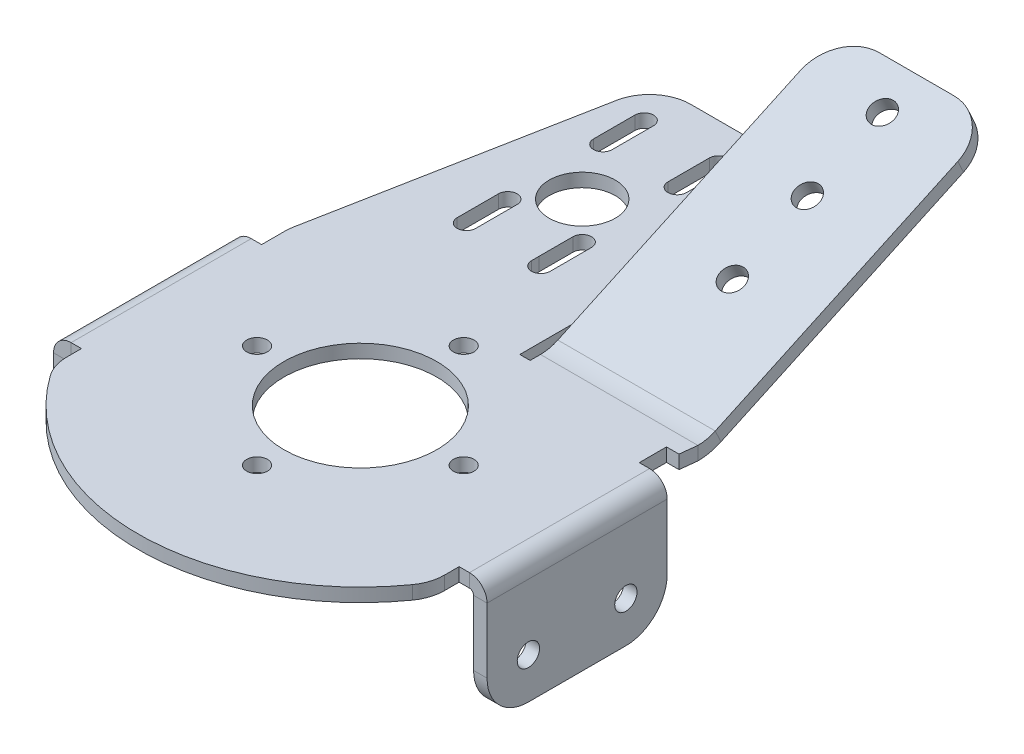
ISO-10303-21;
HEADER;
FILE_DESCRIPTION(('STEP AP214'),'2;1');
FILE_NAME('part.step','',(''),(''),'','','');
FILE_SCHEMA(('AUTOMOTIVE_DESIGN { 1 0 10303 214 1 1 1 1 }'));
ENDSEC;
DATA;
#1=APPLICATION_CONTEXT('core data for automotive mechanical design processes');
#2=APPLICATION_PROTOCOL_DEFINITION('international standard','automotive_design',2000,#1);
#3=PRODUCT_CONTEXT('',#1,'mechanical');
#4=PRODUCT('Part','Part','',(#3));
#5=PRODUCT_RELATED_PRODUCT_CATEGORY('part','',(#4));
#6=PRODUCT_DEFINITION_FORMATION('','',#4);
#7=PRODUCT_DEFINITION_CONTEXT('part definition',#1,'design');
#8=PRODUCT_DEFINITION('design','',#6,#7);
#9=PRODUCT_DEFINITION_SHAPE('','',#8);
#10=(LENGTH_UNIT() NAMED_UNIT(*) SI_UNIT(.MILLI.,.METRE.));
#11=(NAMED_UNIT(*) PLANE_ANGLE_UNIT() SI_UNIT($,.RADIAN.));
#12=(NAMED_UNIT(*) SI_UNIT($,.STERADIAN.) SOLID_ANGLE_UNIT());
#13=UNCERTAINTY_MEASURE_WITH_UNIT(LENGTH_MEASURE(1.E-05),#10,'distance_accuracy_value','');
#14=(GEOMETRIC_REPRESENTATION_CONTEXT(3) GLOBAL_UNCERTAINTY_ASSIGNED_CONTEXT((#13)) GLOBAL_UNIT_ASSIGNED_CONTEXT((#10,
#11,#12)) REPRESENTATION_CONTEXT('',''));
#15=CARTESIAN_POINT('',(0.,0.,0.));
#16=DIRECTION('',(0.,0.,1.));
#17=DIRECTION('',(1.,0.,0.));
#18=AXIS2_PLACEMENT_3D('',#15,#16,#17);
#19=CARTESIAN_POINT('',(0.,0.,0.));
#20=DIRECTION('',(0.,1.,0.));
#21=DIRECTION('',(0.,0.,1.));
#22=AXIS2_PLACEMENT_3D('',#19,#20,#21);
#23=PLANE('',#22);
#24=CARTESIAN_POINT('',(0.,0.,25.));
#25=DIRECTION('',(0.,1.,0.));
#26=DIRECTION('',(0.,0.,1.));
#27=AXIS2_PLACEMENT_3D('',#24,#25,#26);
#28=CIRCLE('',#27,2.5);
#29=CARTESIAN_POINT('',(0.,0.,27.5));
#30=VERTEX_POINT('',#29);
#31=EDGE_CURVE('E1219',#30,#30,#28,.T.);
#32=ORIENTED_EDGE('',*,*,#31,.T.);
#33=EDGE_LOOP('',(#32));
#34=FACE_BOUND('',#33,.T.);
#35=CARTESIAN_POINT('',(25.,0.,0.));
#36=DIRECTION('',(0.,1.,0.));
#37=DIRECTION('',(0.,0.,1.));
#38=AXIS2_PLACEMENT_3D('',#35,#36,#37);
#39=CIRCLE('',#38,2.5);
#40=CARTESIAN_POINT('',(25.,0.,2.5));
#41=VERTEX_POINT('',#40);
#42=EDGE_CURVE('E2407',#41,#41,#39,.T.);
#43=ORIENTED_EDGE('',*,*,#42,.T.);
#44=EDGE_LOOP('',(#43));
#45=FACE_BOUND('',#44,.T.);
#46=CARTESIAN_POINT('',(0.,0.,-25.));
#47=DIRECTION('',(0.,1.,0.));
#48=DIRECTION('',(0.,0.,1.));
#49=AXIS2_PLACEMENT_3D('',#46,#47,#48);
#50=CIRCLE('',#49,2.5);
#51=CARTESIAN_POINT('',(0.,0.,-22.5));
#52=VERTEX_POINT('',#51);
#53=EDGE_CURVE('E2410',#52,#52,#50,.T.);
#54=ORIENTED_EDGE('',*,*,#53,.T.);
#55=EDGE_LOOP('',(#54));
#56=FACE_BOUND('',#55,.T.);
#57=CARTESIAN_POINT('',(-25.,0.,0.));
#58=DIRECTION('',(0.,1.,0.));
#59=DIRECTION('',(0.,0.,1.));
#60=AXIS2_PLACEMENT_3D('',#57,#58,#59);
#61=CIRCLE('',#60,2.5);
#62=CARTESIAN_POINT('',(-25.,0.,2.5));
#63=VERTEX_POINT('',#62);
#64=EDGE_CURVE('E2415',#63,#63,#61,.T.);
#65=ORIENTED_EDGE('',*,*,#64,.T.);
#66=EDGE_LOOP('',(#65));
#67=FACE_BOUND('',#66,.T.);
#68=DIRECTION('',(0.,0.,-1.));
#69=VECTOR('',#68,1.);
#70=CARTESIAN_POINT('',(-45.69,0.,0.));
#71=LINE('',#70,#69);
#72=CARTESIAN_POINT('',(-45.69,0.,-21.79449472));
#73=VERTEX_POINT('',#72);
#74=CARTESIAN_POINT('',(-45.69,0.,-27.4403309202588));
#75=VERTEX_POINT('',#74);
#76=EDGE_CURVE('E961',#73,#75,#71,.T.);
#77=ORIENTED_EDGE('',*,*,#76,.T.);
#78=CARTESIAN_POINT('',(-35.69,0.,-27.4403309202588));
#79=DIRECTION('',(0.,1.,0.));
#80=DIRECTION('',(0.,0.,1.));
#81=AXIS2_PLACEMENT_3D('',#78,#79,#80);
#82=CIRCLE('',#81,10.);
#83=CARTESIAN_POINT('',(-45.5125767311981,0.,-29.3156939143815));
#84=VERTEX_POINT('',#83);
#85=EDGE_CURVE('E1078',#75,#84,#82,.F.);
#86=ORIENTED_EDGE('',*,*,#85,.T.);
#87=DIRECTION('',(-0.187536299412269,0.,0.982257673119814));
#88=VECTOR('',#87,1.);
#89=CARTESIAN_POINT('',(-49.3121193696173,0.,-9.41485379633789));
#90=LINE('',#89,#88);
#91=CARTESIAN_POINT('',(-32.9761860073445,0.,-94.9774672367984));
#92=VERTEX_POINT('',#91);
#93=EDGE_CURVE('E592',#92,#84,#90,.T.);
#94=ORIENTED_EDGE('',*,*,#93,.F.);
#95=CARTESIAN_POINT('',(-23.1536092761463,0.,-93.1021042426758));
#96=DIRECTION('',(0.,1.,0.));
#97=DIRECTION('',(0.,0.,1.));
#98=AXIS2_PLACEMENT_3D('',#95,#96,#97);
#99=CIRCLE('',#98,10.);
#100=CARTESIAN_POINT('',(-23.1536092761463,0.,-103.102104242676));
#101=VERTEX_POINT('',#100);
#102=EDGE_CURVE('E1066',#92,#101,#99,.F.);
#103=ORIENTED_EDGE('',*,*,#102,.T.);
#104=DIRECTION('',(-1.,0.,0.));
#105=VECTOR('',#104,1.);
#106=CARTESIAN_POINT('',(0.,0.,-103.102104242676));
#107=LINE('',#106,#105);
#108=CARTESIAN_POINT('',(-1.425,0.,-103.102104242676));
#109=VERTEX_POINT('',#108);
#110=EDGE_CURVE('E588',#109,#101,#107,.T.);
#111=ORIENTED_EDGE('',*,*,#110,.F.);
#112=CARTESIAN_POINT('',(-1.425,0.,-93.1021042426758));
#113=DIRECTION('',(0.,1.,0.));
#114=DIRECTION('',(0.,0.,1.));
#115=AXIS2_PLACEMENT_3D('',#112,#113,#114);
#116=CIRCLE('',#115,10.);
#117=CARTESIAN_POINT('',(8.575,0.,-93.1021042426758));
#118=VERTEX_POINT('',#117);
#119=EDGE_CURVE('E1069',#109,#118,#116,.F.);
#120=ORIENTED_EDGE('',*,*,#119,.T.);
#121=DIRECTION('',(0.,0.,-1.));
#122=VECTOR('',#121,1.);
#123=CARTESIAN_POINT('',(8.57499999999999,0.,0.));
#124=LINE('',#123,#122);
#125=CARTESIAN_POINT('',(8.575,0.,-30.));
#126=VERTEX_POINT('',#125);
#127=EDGE_CURVE('E799',#126,#118,#124,.T.);
#128=ORIENTED_EDGE('',*,*,#127,.F.);
#129=DIRECTION('',(-1.,0.,0.));
#130=VECTOR('',#129,1.);
#131=CARTESIAN_POINT('',(0.,0.,-30.));
#132=LINE('',#131,#130);
#133=CARTESIAN_POINT('',(11.075,0.,-30.));
#134=VERTEX_POINT('',#133);
#135=EDGE_CURVE('E790',#134,#126,#132,.T.);
#136=ORIENTED_EDGE('',*,*,#135,.F.);
#137=DIRECTION('',(0.,0.,1.));
#138=VECTOR('',#137,1.);
#139=CARTESIAN_POINT('',(11.075,0.,0.));
#140=LINE('',#139,#138);
#141=CARTESIAN_POINT('',(11.075,0.,-32.5));
#142=VERTEX_POINT('',#141);
#143=EDGE_CURVE('E796',#142,#134,#140,.T.);
#144=ORIENTED_EDGE('',*,*,#143,.F.);
#145=DIRECTION('',(1.,0.,0.));
#146=VECTOR('',#145,1.);
#147=CARTESIAN_POINT('',(0.,0.,-32.5));
#148=LINE('',#147,#146);
#149=CARTESIAN_POINT('',(49.175,0.,-32.5));
#150=VERTEX_POINT('',#149);
#151=EDGE_CURVE('E916',#142,#150,#148,.T.);
#152=ORIENTED_EDGE('',*,*,#151,.T.);
#153=DIRECTION('',(-0.113757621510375,0.,0.993508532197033));
#154=VECTOR('',#153,1.);
#155=CARTESIAN_POINT('',(44.8655133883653,0.,5.137141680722));
#156=LINE('',#155,#154);
#157=CARTESIAN_POINT('',(48.7039896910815,0.,-28.3864051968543));
#158=VERTEX_POINT('',#157);
#159=EDGE_CURVE('E920',#150,#158,#156,.T.);
#160=ORIENTED_EDGE('',*,*,#159,.T.);
#161=DIRECTION('',(1.,0.,0.));
#162=VECTOR('',#161,1.);
#163=CARTESIAN_POINT('',(0.,0.,-28.3864051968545));
#164=LINE('',#163,#162);
#165=CARTESIAN_POINT('',(45.69,0.,-28.3864051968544));
#166=VERTEX_POINT('',#165);
#167=EDGE_CURVE('E925',#166,#158,#164,.T.);
#168=ORIENTED_EDGE('',*,*,#167,.F.);
#169=DIRECTION('',(0.,0.,-1.));
#170=VECTOR('',#169,1.);
#171=CARTESIAN_POINT('',(45.69,0.,0.));
#172=LINE('',#171,#170);
#173=CARTESIAN_POINT('',(45.69,0.,-21.79449472));
#174=VERTEX_POINT('',#173);
#175=EDGE_CURVE('E929',#174,#166,#172,.T.);
#176=ORIENTED_EDGE('',*,*,#175,.F.);
#177=DIRECTION('',(-1.,0.,0.));
#178=VECTOR('',#177,1.);
#179=CARTESIAN_POINT('',(0.,0.,-21.79449472));
#180=LINE('',#179,#178);
#181=CARTESIAN_POINT('',(48.19,0.,-21.79449472));
#182=VERTEX_POINT('',#181);
#183=EDGE_CURVE('E933',#182,#174,#180,.T.);
#184=ORIENTED_EDGE('',*,*,#183,.F.);
#185=DIRECTION('',(0.,0.,1.));
#186=VECTOR('',#185,1.);
#187=CARTESIAN_POINT('',(48.19,0.,0.));
#188=LINE('',#187,#186);
#189=CARTESIAN_POINT('',(48.19,0.,21.79449472));
#190=VERTEX_POINT('',#189);
#191=EDGE_CURVE('E937',#182,#190,#188,.T.);
#192=ORIENTED_EDGE('',*,*,#191,.T.);
#193=DIRECTION('',(-1.,0.,0.));
#194=VECTOR('',#193,1.);
#195=CARTESIAN_POINT('',(0.,0.,21.79449472));
#196=LINE('',#195,#194);
#197=CARTESIAN_POINT('',(45.69,0.,21.79449472));
#198=VERTEX_POINT('',#197);
#199=EDGE_CURVE('E940',#190,#198,#196,.T.);
#200=ORIENTED_EDGE('',*,*,#199,.T.);
#201=DIRECTION('',(0.,0.,1.));
#202=VECTOR('',#201,1.);
#203=CARTESIAN_POINT('',(45.69,0.,0.));
#204=LINE('',#203,#202);
#205=CARTESIAN_POINT('',(45.69,0.,25.3729777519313));
#206=VERTEX_POINT('',#205);
#207=EDGE_CURVE('E915',#198,#206,#204,.T.);
#208=ORIENTED_EDGE('',*,*,#207,.T.);
#209=CARTESIAN_POINT('',(35.69,0.,25.3729777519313));
#210=DIRECTION('',(0.,1.,0.));
#211=DIRECTION('',(0.,0.,1.));
#212=AXIS2_PLACEMENT_3D('',#209,#210,#211);
#213=CIRCLE('',#212,10.);
#214=CARTESIAN_POINT('',(43.8402626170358,0.,31.1672179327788));
#215=VERTEX_POINT('',#214);
#216=EDGE_CURVE('E1072',#206,#215,#213,.F.);
#217=ORIENTED_EDGE('',*,*,#216,.T.);
#218=CARTESIAN_POINT('',(0.,0.,0.));
#219=DIRECTION('',(0.,1.,0.));
#220=DIRECTION('',(0.,0.,1.));
#221=AXIS2_PLACEMENT_3D('',#218,#219,#220);
#222=CIRCLE('',#221,53.79);
#223=CARTESIAN_POINT('',(-43.8402626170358,0.,31.1672179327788));
#224=VERTEX_POINT('',#223);
#225=EDGE_CURVE('E910',#224,#215,#222,.T.);
#226=ORIENTED_EDGE('',*,*,#225,.F.);
#227=CARTESIAN_POINT('',(-35.69,0.,25.3729777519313));
#228=DIRECTION('',(0.,1.,0.));
#229=DIRECTION('',(0.,0.,1.));
#230=AXIS2_PLACEMENT_3D('',#227,#228,#229);
#231=CIRCLE('',#230,10.);
#232=CARTESIAN_POINT('',(-45.69,0.,25.3729777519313));
#233=VERTEX_POINT('',#232);
#234=EDGE_CURVE('E1075',#224,#233,#231,.F.);
#235=ORIENTED_EDGE('',*,*,#234,.T.);
#236=DIRECTION('',(0.,0.,1.));
#237=VECTOR('',#236,1.);
#238=CARTESIAN_POINT('',(-45.69,0.,0.));
#239=LINE('',#238,#237);
#240=CARTESIAN_POINT('',(-45.69,0.,21.79449472));
#241=VERTEX_POINT('',#240);
#242=EDGE_CURVE('E914',#241,#233,#239,.T.);
#243=ORIENTED_EDGE('',*,*,#242,.F.);
#244=DIRECTION('',(1.,0.,0.));
#245=VECTOR('',#244,1.);
#246=CARTESIAN_POINT('',(0.,0.,21.79449472));
#247=LINE('',#246,#245);
#248=CARTESIAN_POINT('',(-48.19,0.,21.79449472));
#249=VERTEX_POINT('',#248);
#250=EDGE_CURVE('E950',#249,#241,#247,.T.);
#251=ORIENTED_EDGE('',*,*,#250,.F.);
#252=DIRECTION('',(0.,0.,1.));
#253=VECTOR('',#252,1.);
#254=CARTESIAN_POINT('',(-48.19,0.,0.));
#255=LINE('',#254,#253);
#256=CARTESIAN_POINT('',(-48.19,0.,-21.79449472));
#257=VERTEX_POINT('',#256);
#258=EDGE_CURVE('E954',#257,#249,#255,.T.);
#259=ORIENTED_EDGE('',*,*,#258,.F.);
#260=DIRECTION('',(1.,0.,0.));
#261=VECTOR('',#260,1.);
#262=CARTESIAN_POINT('',(0.,0.,-21.79449472));
#263=LINE('',#262,#261);
#264=EDGE_CURVE('E957',#257,#73,#263,.T.);
#265=ORIENTED_EDGE('',*,*,#264,.T.);
#266=EDGE_LOOP('',(#77,#86,#94,#103,#111,#120,#128,#136,#144,#152,#160,#168,#176,#184,#192,#200,
#208,#217,#226,#235,#243,#251,#259,#265));
#267=FACE_BOUND('',#266,.T.);
#268=CARTESIAN_POINT('',(0.,0.,0.));
#269=DIRECTION('',(0.,1.,0.));
#270=DIRECTION('',(0.,0.,1.));
#271=AXIS2_PLACEMENT_3D('',#268,#269,#270);
#272=CIRCLE('',#271,18.5);
#273=CARTESIAN_POINT('',(0.,0.,18.5));
#274=VERTEX_POINT('',#273);
#275=EDGE_CURVE('E725',#274,#274,#272,.T.);
#276=ORIENTED_EDGE('',*,*,#275,.T.);
#277=EDGE_LOOP('',(#276));
#278=FACE_BOUND('',#277,.T.);
#279=DIRECTION('',(0.,0.,1.));
#280=VECTOR('',#279,1.);
#281=CARTESIAN_POINT('',(-9.675,0.,0.));
#282=LINE('',#281,#280);
#283=CARTESIAN_POINT('',(-9.67500000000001,0.,-61.1014933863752));
#284=VERTEX_POINT('',#283);
#285=CARTESIAN_POINT('',(-9.675,0.,-52.9127439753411));
#286=VERTEX_POINT('',#285);
#287=EDGE_CURVE('E596',#284,#286,#282,.T.);
#288=ORIENTED_EDGE('',*,*,#287,.T.);
#289=DIRECTION('',(0.,0.,1.));
#290=VECTOR('',#289,1.);
#291=CARTESIAN_POINT('',(-9.675,0.,0.));
#292=LINE('',#291,#290);
#293=CARTESIAN_POINT('',(-9.675,0.,-51.1014933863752));
#294=VERTEX_POINT('',#293);
#295=EDGE_CURVE('E532',#286,#294,#292,.T.);
#296=ORIENTED_EDGE('',*,*,#295,.T.);
#297=CARTESIAN_POINT('',(-7.42500000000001,0.,-51.1014933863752));
#298=DIRECTION('',(0.,1.,0.));
#299=DIRECTION('',(0.,0.,1.));
#300=AXIS2_PLACEMENT_3D('',#297,#298,#299);
#301=CIRCLE('',#300,2.25);
#302=CARTESIAN_POINT('',(-5.17500000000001,0.,-51.1014933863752));
#303=VERTEX_POINT('',#302);
#304=EDGE_CURVE('E536',#294,#303,#301,.T.);
#305=ORIENTED_EDGE('',*,*,#304,.T.);
#306=DIRECTION('',(0.,0.,1.));
#307=VECTOR('',#306,1.);
#308=CARTESIAN_POINT('',(-5.175,0.,0.));
#309=LINE('',#308,#307);
#310=CARTESIAN_POINT('',(-5.17500000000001,0.,-53.5404844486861));
#311=VERTEX_POINT('',#310);
#312=EDGE_CURVE('E502',#311,#303,#309,.T.);
#313=ORIENTED_EDGE('',*,*,#312,.F.);
#314=DIRECTION('',(0.,0.,1.));
#315=VECTOR('',#314,1.);
#316=CARTESIAN_POINT('',(-5.175,0.,0.));
#317=LINE('',#316,#315);
#318=CARTESIAN_POINT('',(-5.17500000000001,0.,-61.1014933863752));
#319=VERTEX_POINT('',#318);
#320=EDGE_CURVE('E584',#319,#311,#317,.T.);
#321=ORIENTED_EDGE('',*,*,#320,.F.);
#322=CARTESIAN_POINT('',(-7.42500000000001,0.,-61.1014933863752));
#323=DIRECTION('',(0.,1.,0.));
#324=DIRECTION('',(0.,0.,1.));
#325=AXIS2_PLACEMENT_3D('',#322,#323,#324);
#326=CIRCLE('',#325,2.25);
#327=EDGE_CURVE('E580',#319,#284,#326,.T.);
#328=ORIENTED_EDGE('',*,*,#327,.T.);
#329=EDGE_LOOP('',(#288,#296,#305,#313,#321,#328));
#330=FACE_BOUND('',#329,.T.);
#331=CARTESIAN_POINT('',(-7.42500000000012,0.,-84.1014933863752));
#332=DIRECTION('',(0.,1.,0.));
#333=DIRECTION('',(0.,0.,1.));
#334=AXIS2_PLACEMENT_3D('',#331,#332,#333);
#335=CIRCLE('',#334,2.25);
#336=CARTESIAN_POINT('',(-9.67500000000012,0.,-84.1014933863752));
#337=VERTEX_POINT('',#336);
#338=CARTESIAN_POINT('',(-5.17500000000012,0.,-84.1014933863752));
#339=VERTEX_POINT('',#338);
#340=EDGE_CURVE('E540',#337,#339,#335,.T.);
#341=ORIENTED_EDGE('',*,*,#340,.T.);
#342=DIRECTION('',(0.,0.,1.));
#343=VECTOR('',#342,1.);
#344=CARTESIAN_POINT('',(-5.17500000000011,0.,0.));
#345=LINE('',#344,#343);
#346=CARTESIAN_POINT('',(-5.17500000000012,0.,-94.1014933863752));
#347=VERTEX_POINT('',#346);
#348=EDGE_CURVE('E550',#347,#339,#345,.T.);
#349=ORIENTED_EDGE('',*,*,#348,.F.);
#350=CARTESIAN_POINT('',(-7.42500000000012,0.,-94.1014933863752));
#351=DIRECTION('',(0.,1.,0.));
#352=DIRECTION('',(0.,0.,1.));
#353=AXIS2_PLACEMENT_3D('',#350,#351,#352);
#354=CIRCLE('',#353,2.25);
#355=CARTESIAN_POINT('',(-9.67500000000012,0.,-94.1014933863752));
#356=VERTEX_POINT('',#355);
#357=EDGE_CURVE('E547',#347,#356,#354,.T.);
#358=ORIENTED_EDGE('',*,*,#357,.T.);
#359=DIRECTION('',(0.,0.,1.));
#360=VECTOR('',#359,1.);
#361=CARTESIAN_POINT('',(-9.6750000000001,0.,0.));
#362=LINE('',#361,#360);
#363=EDGE_CURVE('E543',#356,#337,#362,.T.);
#364=ORIENTED_EDGE('',*,*,#363,.T.);
#365=EDGE_LOOP('',(#341,#349,#358,#364));
#366=FACE_BOUND('',#365,.T.);
#367=CARTESIAN_POINT('',(-25.4250000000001,0.,-84.101493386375));
#368=DIRECTION('',(0.,1.,0.));
#369=DIRECTION('',(0.,0.,1.));
#370=AXIS2_PLACEMENT_3D('',#367,#368,#369);
#371=CIRCLE('',#370,2.25);
#372=CARTESIAN_POINT('',(-27.6750000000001,0.,-84.101493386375));
#373=VERTEX_POINT('',#372);
#374=CARTESIAN_POINT('',(-23.1750000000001,0.,-84.101493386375));
#375=VERTEX_POINT('',#374);
#376=EDGE_CURVE('E554',#373,#375,#371,.T.);
#377=ORIENTED_EDGE('',*,*,#376,.T.);
#378=DIRECTION('',(0.,0.,1.));
#379=VECTOR('',#378,1.);
#380=CARTESIAN_POINT('',(-23.1750000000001,0.,0.));
#381=LINE('',#380,#379);
#382=CARTESIAN_POINT('',(-23.1750000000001,0.,-94.101493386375));
#383=VERTEX_POINT('',#382);
#384=EDGE_CURVE('E563',#383,#375,#381,.T.);
#385=ORIENTED_EDGE('',*,*,#384,.F.);
#386=CARTESIAN_POINT('',(-25.4250000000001,0.,-94.101493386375));
#387=DIRECTION('',(0.,1.,0.));
#388=DIRECTION('',(0.,0.,1.));
#389=AXIS2_PLACEMENT_3D('',#386,#387,#388);
#390=CIRCLE('',#389,2.25);
#391=CARTESIAN_POINT('',(-27.6750000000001,0.,-94.101493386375));
#392=VERTEX_POINT('',#391);
#393=EDGE_CURVE('E560',#383,#392,#390,.T.);
#394=ORIENTED_EDGE('',*,*,#393,.T.);
#395=DIRECTION('',(0.,0.,1.));
#396=VECTOR('',#395,1.);
#397=CARTESIAN_POINT('',(-27.6750000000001,0.,0.));
#398=LINE('',#397,#396);
#399=EDGE_CURVE('E557',#392,#373,#398,.T.);
#400=ORIENTED_EDGE('',*,*,#399,.T.);
#401=EDGE_LOOP('',(#377,#385,#394,#400));
#402=FACE_BOUND('',#401,.T.);
#403=CARTESIAN_POINT('',(-25.425,0.,-51.101493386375));
#404=DIRECTION('',(0.,1.,0.));
#405=DIRECTION('',(0.,0.,1.));
#406=AXIS2_PLACEMENT_3D('',#403,#404,#405);
#407=CIRCLE('',#406,2.25);
#408=CARTESIAN_POINT('',(-27.675,0.,-51.101493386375));
#409=VERTEX_POINT('',#408);
#410=CARTESIAN_POINT('',(-23.175,0.,-51.101493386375));
#411=VERTEX_POINT('',#410);
#412=EDGE_CURVE('E567',#409,#411,#407,.T.);
#413=ORIENTED_EDGE('',*,*,#412,.T.);
#414=DIRECTION('',(0.,0.,1.));
#415=VECTOR('',#414,1.);
#416=CARTESIAN_POINT('',(-23.175,0.,0.));
#417=LINE('',#416,#415);
#418=CARTESIAN_POINT('',(-23.175,0.,-61.101493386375));
#419=VERTEX_POINT('',#418);
#420=EDGE_CURVE('E576',#419,#411,#417,.T.);
#421=ORIENTED_EDGE('',*,*,#420,.F.);
#422=CARTESIAN_POINT('',(-25.425,0.,-61.101493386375));
#423=DIRECTION('',(0.,1.,0.));
#424=DIRECTION('',(0.,0.,1.));
#425=AXIS2_PLACEMENT_3D('',#422,#423,#424);
#426=CIRCLE('',#425,2.25);
#427=CARTESIAN_POINT('',(-27.675,0.,-61.101493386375));
#428=VERTEX_POINT('',#427);
#429=EDGE_CURVE('E573',#419,#428,#426,.T.);
#430=ORIENTED_EDGE('',*,*,#429,.T.);
#431=DIRECTION('',(0.,0.,1.));
#432=VECTOR('',#431,1.);
#433=CARTESIAN_POINT('',(-27.675,0.,0.));
#434=LINE('',#433,#432);
#435=EDGE_CURVE('E570',#428,#409,#434,.T.);
#436=ORIENTED_EDGE('',*,*,#435,.T.);
#437=EDGE_LOOP('',(#413,#421,#430,#436));
#438=FACE_BOUND('',#437,.T.);
#439=CARTESIAN_POINT('',(-16.425,0.,-70.1014933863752));
#440=DIRECTION('',(0.,1.,0.));
#441=DIRECTION('',(0.,0.,1.));
#442=AXIS2_PLACEMENT_3D('',#439,#440,#441);
#443=CIRCLE('',#442,7.99999999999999);
#444=CARTESIAN_POINT('',(-16.425,0.,-62.1014933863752));
#445=VERTEX_POINT('',#444);
#446=EDGE_CURVE('E600',#445,#445,#443,.T.);
#447=ORIENTED_EDGE('',*,*,#446,.T.);
#448=EDGE_LOOP('',(#447));
#449=FACE_BOUND('',#448,.T.);
#450=ADVANCED_FACE('F113',(#34,#45,#56,#67,#267,#278,#330,#366,#402,#438,#449),#23,.F.);
#451=CARTESIAN_POINT('',(0.,3.26,0.));
#452=DIRECTION('',(0.,1.,0.));
#453=DIRECTION('',(0.,0.,1.));
#454=AXIS2_PLACEMENT_3D('',#451,#452,#453);
#455=PLANE('',#454);
#456=CARTESIAN_POINT('',(0.,3.26,25.));
#457=DIRECTION('',(0.,1.,0.));
#458=DIRECTION('',(0.,0.,1.));
#459=AXIS2_PLACEMENT_3D('',#456,#457,#458);
#460=CIRCLE('',#459,2.5);
#461=CARTESIAN_POINT('',(0.,3.26,27.5));
#462=VERTEX_POINT('',#461);
#463=EDGE_CURVE('E2403',#462,#462,#460,.T.);
#464=ORIENTED_EDGE('',*,*,#463,.F.);
#465=EDGE_LOOP('',(#464));
#466=FACE_BOUND('',#465,.T.);
#467=CARTESIAN_POINT('',(25.,3.26,0.));
#468=DIRECTION('',(0.,1.,0.));
#469=DIRECTION('',(0.,0.,1.));
#470=AXIS2_PLACEMENT_3D('',#467,#468,#469);
#471=CIRCLE('',#470,2.5);
#472=CARTESIAN_POINT('',(25.,3.26,2.5));
#473=VERTEX_POINT('',#472);
#474=EDGE_CURVE('E2429',#473,#473,#471,.T.);
#475=ORIENTED_EDGE('',*,*,#474,.F.);
#476=EDGE_LOOP('',(#475));
#477=FACE_BOUND('',#476,.T.);
#478=CARTESIAN_POINT('',(0.,3.26,-25.));
#479=DIRECTION('',(0.,1.,0.));
#480=DIRECTION('',(0.,0.,1.));
#481=AXIS2_PLACEMENT_3D('',#478,#479,#480);
#482=CIRCLE('',#481,2.5);
#483=CARTESIAN_POINT('',(0.,3.26,-22.5));
#484=VERTEX_POINT('',#483);
#485=EDGE_CURVE('E2425',#484,#484,#482,.T.);
#486=ORIENTED_EDGE('',*,*,#485,.F.);
#487=EDGE_LOOP('',(#486));
#488=FACE_BOUND('',#487,.T.);
#489=CARTESIAN_POINT('',(-25.,3.26,0.));
#490=DIRECTION('',(0.,1.,0.));
#491=DIRECTION('',(0.,0.,1.));
#492=AXIS2_PLACEMENT_3D('',#489,#490,#491);
#493=CIRCLE('',#492,2.5);
#494=CARTESIAN_POINT('',(-25.,3.26,2.5));
#495=VERTEX_POINT('',#494);
#496=EDGE_CURVE('E2421',#495,#495,#493,.T.);
#497=ORIENTED_EDGE('',*,*,#496,.F.);
#498=EDGE_LOOP('',(#497));
#499=FACE_BOUND('',#498,.T.);
#500=DIRECTION('',(0.,0.,1.));
#501=VECTOR('',#500,1.);
#502=CARTESIAN_POINT('',(-9.67500000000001,3.26,-61.1014933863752));
#503=LINE('',#502,#501);
#504=CARTESIAN_POINT('',(-9.675,3.26,-52.9127439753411));
#505=VERTEX_POINT('',#504);
#506=CARTESIAN_POINT('',(-9.675,3.26,-51.1014933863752));
#507=VERTEX_POINT('',#506);
#508=EDGE_CURVE('E516',#505,#507,#503,.T.);
#509=ORIENTED_EDGE('',*,*,#508,.F.);
#510=DIRECTION('',(0.,0.,1.));
#511=VECTOR('',#510,1.);
#512=CARTESIAN_POINT('',(-9.675,3.26,0.));
#513=LINE('',#512,#511);
#514=CARTESIAN_POINT('',(-9.67500000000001,3.26,-61.1014933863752));
#515=VERTEX_POINT('',#514);
#516=EDGE_CURVE('E660',#515,#505,#513,.T.);
#517=ORIENTED_EDGE('',*,*,#516,.F.);
#518=CARTESIAN_POINT('',(-7.42500000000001,3.26,-61.1014933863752));
#519=DIRECTION('',(0.,1.,0.));
#520=DIRECTION('',(0.,0.,1.));
#521=AXIS2_PLACEMENT_3D('',#518,#519,#520);
#522=CIRCLE('',#521,2.25);
#523=CARTESIAN_POINT('',(-5.17500000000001,3.26,-61.1014933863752));
#524=VERTEX_POINT('',#523);
#525=EDGE_CURVE('E646',#524,#515,#522,.T.);
#526=ORIENTED_EDGE('',*,*,#525,.F.);
#527=DIRECTION('',(0.,0.,1.));
#528=VECTOR('',#527,1.);
#529=CARTESIAN_POINT('',(-5.175,3.26,0.));
#530=LINE('',#529,#528);
#531=CARTESIAN_POINT('',(-5.17500000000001,3.26,-53.5404844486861));
#532=VERTEX_POINT('',#531);
#533=EDGE_CURVE('E523',#524,#532,#530,.T.);
#534=ORIENTED_EDGE('',*,*,#533,.T.);
#535=DIRECTION('',(0.,0.,1.));
#536=VECTOR('',#535,1.);
#537=CARTESIAN_POINT('',(-5.17500000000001,3.26,-61.1014933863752));
#538=LINE('',#537,#536);
#539=CARTESIAN_POINT('',(-5.17500000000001,3.26,-51.1014933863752));
#540=VERTEX_POINT('',#539);
#541=EDGE_CURVE('E499',#532,#540,#538,.T.);
#542=ORIENTED_EDGE('',*,*,#541,.T.);
#543=CARTESIAN_POINT('',(-7.42500000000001,3.26,-51.1014933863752));
#544=DIRECTION('',(0.,1.,0.));
#545=DIRECTION('',(0.,0.,1.));
#546=AXIS2_PLACEMENT_3D('',#543,#544,#545);
#547=CIRCLE('',#546,2.25);
#548=EDGE_CURVE('E510',#507,#540,#547,.T.);
#549=ORIENTED_EDGE('',*,*,#548,.F.);
#550=EDGE_LOOP('',(#509,#517,#526,#534,#542,#549));
#551=FACE_BOUND('',#550,.T.);
#552=DIRECTION('',(-0.187536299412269,0.,0.982257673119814));
#553=VECTOR('',#552,1.);
#554=CARTESIAN_POINT('',(-49.3121193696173,3.26,-9.41485379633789));
#555=LINE('',#554,#553);
#556=CARTESIAN_POINT('',(-32.9761860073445,3.26,-94.9774672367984));
#557=VERTEX_POINT('',#556);
#558=CARTESIAN_POINT('',(-45.5125767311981,3.26,-29.3156939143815));
#559=VERTEX_POINT('',#558);
#560=EDGE_CURVE('E656',#557,#559,#555,.T.);
#561=ORIENTED_EDGE('',*,*,#560,.T.);
#562=CARTESIAN_POINT('',(-35.69,3.26,-27.4403309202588));
#563=DIRECTION('',(0.,1.,0.));
#564=DIRECTION('',(0.,0.,1.));
#565=AXIS2_PLACEMENT_3D('',#562,#563,#564);
#566=CIRCLE('',#565,10.);
#567=CARTESIAN_POINT('',(-45.69,3.26,-27.4403309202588));
#568=VERTEX_POINT('',#567);
#569=EDGE_CURVE('E1099',#559,#568,#566,.T.);
#570=ORIENTED_EDGE('',*,*,#569,.T.);
#571=DIRECTION('',(0.,0.,1.));
#572=VECTOR('',#571,1.);
#573=CARTESIAN_POINT('',(-45.69,3.26,0.));
#574=LINE('',#573,#572);
#575=CARTESIAN_POINT('',(-45.69,3.26,-21.79449472));
#576=VERTEX_POINT('',#575);
#577=EDGE_CURVE('E921',#576,#568,#574,.F.);
#578=ORIENTED_EDGE('',*,*,#577,.F.);
#579=DIRECTION('',(1.,0.,0.));
#580=VECTOR('',#579,1.);
#581=CARTESIAN_POINT('',(0.,3.26,-21.79449472));
#582=LINE('',#581,#580);
#583=CARTESIAN_POINT('',(-48.19,3.26,-21.79449472));
#584=VERTEX_POINT('',#583);
#585=EDGE_CURVE('E969',#584,#576,#582,.T.);
#586=ORIENTED_EDGE('',*,*,#585,.F.);
#587=DIRECTION('',(0.,0.,1.));
#588=VECTOR('',#587,1.);
#589=CARTESIAN_POINT('',(-48.19,3.26,0.));
#590=LINE('',#589,#588);
#591=CARTESIAN_POINT('',(-48.19,3.26,21.79449472));
#592=VERTEX_POINT('',#591);
#593=EDGE_CURVE('E973',#584,#592,#590,.T.);
#594=ORIENTED_EDGE('',*,*,#593,.T.);
#595=DIRECTION('',(1.,0.,0.));
#596=VECTOR('',#595,1.);
#597=CARTESIAN_POINT('',(0.,3.26,21.79449472));
#598=LINE('',#597,#596);
#599=CARTESIAN_POINT('',(-45.69,3.26,21.79449472));
#600=VERTEX_POINT('',#599);
#601=EDGE_CURVE('E977',#592,#600,#598,.T.);
#602=ORIENTED_EDGE('',*,*,#601,.T.);
#603=DIRECTION('',(0.,0.,1.));
#604=VECTOR('',#603,1.);
#605=CARTESIAN_POINT('',(-45.69,3.26,0.));
#606=LINE('',#605,#604);
#607=CARTESIAN_POINT('',(-45.69,3.26,25.3729777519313));
#608=VERTEX_POINT('',#607);
#609=EDGE_CURVE('E981',#600,#608,#606,.T.);
#610=ORIENTED_EDGE('',*,*,#609,.T.);
#611=CARTESIAN_POINT('',(-35.69,3.26,25.3729777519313));
#612=DIRECTION('',(0.,1.,0.));
#613=DIRECTION('',(0.,0.,1.));
#614=AXIS2_PLACEMENT_3D('',#611,#612,#613);
#615=CIRCLE('',#614,10.);
#616=CARTESIAN_POINT('',(-43.8402626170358,3.26,31.1672179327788));
#617=VERTEX_POINT('',#616);
#618=EDGE_CURVE('E1096',#608,#617,#615,.T.);
#619=ORIENTED_EDGE('',*,*,#618,.T.);
#620=CARTESIAN_POINT('',(0.,3.26,0.));
#621=DIRECTION('',(0.,1.,0.));
#622=DIRECTION('',(0.,0.,1.));
#623=AXIS2_PLACEMENT_3D('',#620,#621,#622);
#624=CIRCLE('',#623,53.79);
#625=CARTESIAN_POINT('',(43.8402626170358,3.26,31.1672179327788));
#626=VERTEX_POINT('',#625);
#627=EDGE_CURVE('E985',#617,#626,#624,.T.);
#628=ORIENTED_EDGE('',*,*,#627,.T.);
#629=CARTESIAN_POINT('',(35.69,3.26,25.3729777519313));
#630=DIRECTION('',(0.,1.,0.));
#631=DIRECTION('',(0.,0.,1.));
#632=AXIS2_PLACEMENT_3D('',#629,#630,#631);
#633=CIRCLE('',#632,10.);
#634=CARTESIAN_POINT('',(45.69,3.26,25.3729777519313));
#635=VERTEX_POINT('',#634);
#636=EDGE_CURVE('E1093',#626,#635,#633,.T.);
#637=ORIENTED_EDGE('',*,*,#636,.T.);
#638=DIRECTION('',(0.,0.,1.));
#639=VECTOR('',#638,1.);
#640=CARTESIAN_POINT('',(45.69,3.26,0.));
#641=LINE('',#640,#639);
#642=CARTESIAN_POINT('',(45.69,3.26,21.79449472));
#643=VERTEX_POINT('',#642);
#644=EDGE_CURVE('E989',#643,#635,#641,.T.);
#645=ORIENTED_EDGE('',*,*,#644,.F.);
#646=DIRECTION('',(1.,0.,0.));
#647=VECTOR('',#646,1.);
#648=CARTESIAN_POINT('',(0.,3.26,21.79449472));
#649=LINE('',#648,#647);
#650=CARTESIAN_POINT('',(48.19,3.26,21.79449472));
#651=VERTEX_POINT('',#650);
#652=EDGE_CURVE('E993',#651,#643,#649,.F.);
#653=ORIENTED_EDGE('',*,*,#652,.F.);
#654=DIRECTION('',(0.,0.,1.));
#655=VECTOR('',#654,1.);
#656=CARTESIAN_POINT('',(48.19,3.26,0.));
#657=LINE('',#656,#655);
#658=CARTESIAN_POINT('',(48.19,3.26,-21.79449472));
#659=VERTEX_POINT('',#658);
#660=EDGE_CURVE('E997',#659,#651,#657,.T.);
#661=ORIENTED_EDGE('',*,*,#660,.F.);
#662=DIRECTION('',(1.,0.,0.));
#663=VECTOR('',#662,1.);
#664=CARTESIAN_POINT('',(0.,3.26,-21.79449472));
#665=LINE('',#664,#663);
#666=CARTESIAN_POINT('',(45.69,3.26,-21.79449472));
#667=VERTEX_POINT('',#666);
#668=EDGE_CURVE('E1001',#659,#667,#665,.F.);
#669=ORIENTED_EDGE('',*,*,#668,.T.);
#670=DIRECTION('',(0.,0.,1.));
#671=VECTOR('',#670,1.);
#672=CARTESIAN_POINT('',(45.69,3.26,0.));
#673=LINE('',#672,#671);
#674=CARTESIAN_POINT('',(45.69,3.26,-28.3864051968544));
#675=VERTEX_POINT('',#674);
#676=EDGE_CURVE('E1005',#667,#675,#673,.F.);
#677=ORIENTED_EDGE('',*,*,#676,.T.);
#678=DIRECTION('',(1.,0.,0.));
#679=VECTOR('',#678,1.);
#680=CARTESIAN_POINT('',(0.,3.26,-28.3864051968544));
#681=LINE('',#680,#679);
#682=CARTESIAN_POINT('',(48.7039896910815,3.26,-28.3864051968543));
#683=VERTEX_POINT('',#682);
#684=EDGE_CURVE('E1009',#675,#683,#681,.T.);
#685=ORIENTED_EDGE('',*,*,#684,.T.);
#686=DIRECTION('',(-0.113757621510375,0.,0.993508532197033));
#687=VECTOR('',#686,1.);
#688=CARTESIAN_POINT('',(44.8655133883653,3.26,5.137141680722));
#689=LINE('',#688,#687);
#690=CARTESIAN_POINT('',(49.175,3.26,-32.5));
#691=VERTEX_POINT('',#690);
#692=EDGE_CURVE('E1013',#691,#683,#689,.T.);
#693=ORIENTED_EDGE('',*,*,#692,.F.);
#694=DIRECTION('',(1.,0.,0.));
#695=VECTOR('',#694,1.);
#696=CARTESIAN_POINT('',(0.,3.26,-32.5));
#697=LINE('',#696,#695);
#698=CARTESIAN_POINT('',(11.075,3.26,-32.5));
#699=VERTEX_POINT('',#698);
#700=EDGE_CURVE('E898',#699,#691,#697,.T.);
#701=ORIENTED_EDGE('',*,*,#700,.F.);
#702=DIRECTION('',(0.,0.,1.));
#703=VECTOR('',#702,1.);
#704=CARTESIAN_POINT('',(11.075,3.26,0.));
#705=LINE('',#704,#703);
#706=CARTESIAN_POINT('',(11.075,3.26,-30.));
#707=VERTEX_POINT('',#706);
#708=EDGE_CURVE('E1058',#699,#707,#705,.T.);
#709=ORIENTED_EDGE('',*,*,#708,.T.);
#710=DIRECTION('',(-1.,0.,0.));
#711=VECTOR('',#710,1.);
#712=CARTESIAN_POINT('',(0.,3.26,-30.));
#713=LINE('',#712,#711);
#714=CARTESIAN_POINT('',(8.575,3.26,-30.));
#715=VERTEX_POINT('',#714);
#716=EDGE_CURVE('E782',#707,#715,#713,.T.);
#717=ORIENTED_EDGE('',*,*,#716,.T.);
#718=DIRECTION('',(0.,0.,-1.));
#719=VECTOR('',#718,1.);
#720=CARTESIAN_POINT('',(8.57499999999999,3.26,0.));
#721=LINE('',#720,#719);
#722=CARTESIAN_POINT('',(8.575,3.26,-93.1021042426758));
#723=VERTEX_POINT('',#722);
#724=EDGE_CURVE('E767',#715,#723,#721,.T.);
#725=ORIENTED_EDGE('',*,*,#724,.T.);
#726=CARTESIAN_POINT('',(-1.425,3.26,-93.1021042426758));
#727=DIRECTION('',(0.,1.,0.));
#728=DIRECTION('',(0.,0.,1.));
#729=AXIS2_PLACEMENT_3D('',#726,#727,#728);
#730=CIRCLE('',#729,10.);
#731=CARTESIAN_POINT('',(-1.425,3.26,-103.102104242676));
#732=VERTEX_POINT('',#731);
#733=EDGE_CURVE('E1090',#723,#732,#730,.T.);
#734=ORIENTED_EDGE('',*,*,#733,.T.);
#735=DIRECTION('',(-1.,0.,0.));
#736=VECTOR('',#735,1.);
#737=CARTESIAN_POINT('',(0.,3.26,-103.102104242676));
#738=LINE('',#737,#736);
#739=CARTESIAN_POINT('',(-23.1536092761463,3.26,-103.102104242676));
#740=VERTEX_POINT('',#739);
#741=EDGE_CURVE('E652',#732,#740,#738,.T.);
#742=ORIENTED_EDGE('',*,*,#741,.T.);
#743=CARTESIAN_POINT('',(-23.1536092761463,3.26,-93.1021042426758));
#744=DIRECTION('',(0.,1.,0.));
#745=DIRECTION('',(0.,0.,1.));
#746=AXIS2_PLACEMENT_3D('',#743,#744,#745);
#747=CIRCLE('',#746,10.);
#748=EDGE_CURVE('E1087',#740,#557,#747,.T.);
#749=ORIENTED_EDGE('',*,*,#748,.T.);
#750=EDGE_LOOP('',(#561,#570,#578,#586,#594,#602,#610,#619,#628,#637,#645,#653,#661,#669,#677,
#685,#693,#701,#709,#717,#725,#734,#742,#749));
#751=FACE_BOUND('',#750,.T.);
#752=CARTESIAN_POINT('',(0.,3.26,0.));
#753=DIRECTION('',(0.,1.,0.));
#754=DIRECTION('',(0.,0.,1.));
#755=AXIS2_PLACEMENT_3D('',#752,#753,#754);
#756=CIRCLE('',#755,18.5);
#757=CARTESIAN_POINT('',(0.,3.26,18.5));
#758=VERTEX_POINT('',#757);
#759=EDGE_CURVE('E671',#758,#758,#756,.T.);
#760=ORIENTED_EDGE('',*,*,#759,.F.);
#761=EDGE_LOOP('',(#760));
#762=FACE_BOUND('',#761,.T.);
#763=CARTESIAN_POINT('',(-7.42500000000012,3.26,-84.1014933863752));
#764=DIRECTION('',(0.,1.,0.));
#765=DIRECTION('',(0.,0.,1.));
#766=AXIS2_PLACEMENT_3D('',#763,#764,#765);
#767=CIRCLE('',#766,2.25);
#768=CARTESIAN_POINT('',(-9.67500000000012,3.26,-84.1014933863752));
#769=VERTEX_POINT('',#768);
#770=CARTESIAN_POINT('',(-5.17500000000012,3.26,-84.1014933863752));
#771=VERTEX_POINT('',#770);
#772=EDGE_CURVE('E539',#769,#771,#767,.T.);
#773=ORIENTED_EDGE('',*,*,#772,.F.);
#774=DIRECTION('',(0.,0.,1.));
#775=VECTOR('',#774,1.);
#776=CARTESIAN_POINT('',(-9.6750000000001,3.26,0.));
#777=LINE('',#776,#775);
#778=CARTESIAN_POINT('',(-9.67500000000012,3.26,-94.1014933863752));
#779=VERTEX_POINT('',#778);
#780=EDGE_CURVE('E608',#779,#769,#777,.T.);
#781=ORIENTED_EDGE('',*,*,#780,.F.);
#782=CARTESIAN_POINT('',(-7.42500000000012,3.26,-94.1014933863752));
#783=DIRECTION('',(0.,1.,0.));
#784=DIRECTION('',(0.,0.,1.));
#785=AXIS2_PLACEMENT_3D('',#782,#783,#784);
#786=CIRCLE('',#785,2.25);
#787=CARTESIAN_POINT('',(-5.17500000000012,3.26,-94.1014933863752));
#788=VERTEX_POINT('',#787);
#789=EDGE_CURVE('E611',#788,#779,#786,.T.);
#790=ORIENTED_EDGE('',*,*,#789,.F.);
#791=DIRECTION('',(0.,0.,1.));
#792=VECTOR('',#791,1.);
#793=CARTESIAN_POINT('',(-5.17500000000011,3.26,0.));
#794=LINE('',#793,#792);
#795=EDGE_CURVE('E614',#788,#771,#794,.T.);
#796=ORIENTED_EDGE('',*,*,#795,.T.);
#797=EDGE_LOOP('',(#773,#781,#790,#796));
#798=FACE_BOUND('',#797,.T.);
#799=CARTESIAN_POINT('',(-25.4250000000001,3.26,-84.101493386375));
#800=DIRECTION('',(0.,1.,0.));
#801=DIRECTION('',(0.,0.,1.));
#802=AXIS2_PLACEMENT_3D('',#799,#800,#801);
#803=CIRCLE('',#802,2.25);
#804=CARTESIAN_POINT('',(-27.6750000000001,3.26,-84.101493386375));
#805=VERTEX_POINT('',#804);
#806=CARTESIAN_POINT('',(-23.1750000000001,3.26,-84.101493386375));
#807=VERTEX_POINT('',#806);
#808=EDGE_CURVE('E618',#805,#807,#803,.T.);
#809=ORIENTED_EDGE('',*,*,#808,.F.);
#810=DIRECTION('',(0.,0.,1.));
#811=VECTOR('',#810,1.);
#812=CARTESIAN_POINT('',(-27.6750000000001,3.26,0.));
#813=LINE('',#812,#811);
#814=CARTESIAN_POINT('',(-27.6750000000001,3.26,-94.101493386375));
#815=VERTEX_POINT('',#814);
#816=EDGE_CURVE('E622',#815,#805,#813,.T.);
#817=ORIENTED_EDGE('',*,*,#816,.F.);
#818=CARTESIAN_POINT('',(-25.4250000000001,3.26,-94.101493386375));
#819=DIRECTION('',(0.,1.,0.));
#820=DIRECTION('',(0.,0.,1.));
#821=AXIS2_PLACEMENT_3D('',#818,#819,#820);
#822=CIRCLE('',#821,2.25);
#823=CARTESIAN_POINT('',(-23.1750000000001,3.26,-94.101493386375));
#824=VERTEX_POINT('',#823);
#825=EDGE_CURVE('E625',#824,#815,#822,.T.);
#826=ORIENTED_EDGE('',*,*,#825,.F.);
#827=DIRECTION('',(0.,0.,1.));
#828=VECTOR('',#827,1.);
#829=CARTESIAN_POINT('',(-23.1750000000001,3.26,0.));
#830=LINE('',#829,#828);
#831=EDGE_CURVE('E628',#824,#807,#830,.T.);
#832=ORIENTED_EDGE('',*,*,#831,.T.);
#833=EDGE_LOOP('',(#809,#817,#826,#832));
#834=FACE_BOUND('',#833,.T.);
#835=CARTESIAN_POINT('',(-25.425,3.26,-51.101493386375));
#836=DIRECTION('',(0.,1.,0.));
#837=DIRECTION('',(0.,0.,1.));
#838=AXIS2_PLACEMENT_3D('',#835,#836,#837);
#839=CIRCLE('',#838,2.25);
#840=CARTESIAN_POINT('',(-27.675,3.26,-51.101493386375));
#841=VERTEX_POINT('',#840);
#842=CARTESIAN_POINT('',(-23.175,3.26,-51.101493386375));
#843=VERTEX_POINT('',#842);
#844=EDGE_CURVE('E632',#841,#843,#839,.T.);
#845=ORIENTED_EDGE('',*,*,#844,.F.);
#846=DIRECTION('',(0.,0.,1.));
#847=VECTOR('',#846,1.);
#848=CARTESIAN_POINT('',(-27.675,3.26,0.));
#849=LINE('',#848,#847);
#850=CARTESIAN_POINT('',(-27.675,3.26,-61.101493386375));
#851=VERTEX_POINT('',#850);
#852=EDGE_CURVE('E636',#851,#841,#849,.T.);
#853=ORIENTED_EDGE('',*,*,#852,.F.);
#854=CARTESIAN_POINT('',(-25.425,3.26,-61.101493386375));
#855=DIRECTION('',(0.,1.,0.));
#856=DIRECTION('',(0.,0.,1.));
#857=AXIS2_PLACEMENT_3D('',#854,#855,#856);
#858=CIRCLE('',#857,2.25);
#859=CARTESIAN_POINT('',(-23.175,3.26,-61.101493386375));
#860=VERTEX_POINT('',#859);
#861=EDGE_CURVE('E639',#860,#851,#858,.T.);
#862=ORIENTED_EDGE('',*,*,#861,.F.);
#863=DIRECTION('',(0.,0.,1.));
#864=VECTOR('',#863,1.);
#865=CARTESIAN_POINT('',(-23.175,3.26,0.));
#866=LINE('',#865,#864);
#867=EDGE_CURVE('E642',#860,#843,#866,.T.);
#868=ORIENTED_EDGE('',*,*,#867,.T.);
#869=EDGE_LOOP('',(#845,#853,#862,#868));
#870=FACE_BOUND('',#869,.T.);
#871=CARTESIAN_POINT('',(-16.425,3.26,-70.1014933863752));
#872=DIRECTION('',(0.,1.,0.));
#873=DIRECTION('',(0.,0.,1.));
#874=AXIS2_PLACEMENT_3D('',#871,#872,#873);
#875=CIRCLE('',#874,7.99999999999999);
#876=CARTESIAN_POINT('',(-16.425,3.26,-62.1014933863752));
#877=VERTEX_POINT('',#876);
#878=EDGE_CURVE('E544',#877,#877,#875,.T.);
#879=ORIENTED_EDGE('',*,*,#878,.F.);
#880=EDGE_LOOP('',(#879));
#881=FACE_BOUND('',#880,.T.);
#882=ADVANCED_FACE('F519',(#466,#477,#488,#499,#551,#751,#762,#798,#834,#870,#881),#455,.T.);
#883=CARTESIAN_POINT('',(44.8655133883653,0.,5.137141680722));
#884=DIRECTION('',(-0.993508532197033,0.,-0.113757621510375));
#885=DIRECTION('',(-0.113757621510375,0.,0.993508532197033));
#886=AXIS2_PLACEMENT_3D('',#883,#884,#885);
#887=PLANE('',#886);
#888=DIRECTION('',(0.,-1.,0.));
#889=VECTOR('',#888,1.);
#890=CARTESIAN_POINT('',(49.175,0.,-32.5));
#891=LINE('',#890,#889);
#892=EDGE_CURVE('E1050',#691,#150,#891,.T.);
#893=ORIENTED_EDGE('',*,*,#892,.F.);
#894=ORIENTED_EDGE('',*,*,#692,.T.);
#895=DIRECTION('',(0.,-1.,0.));
#896=VECTOR('',#895,1.);
#897=CARTESIAN_POINT('',(48.7039896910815,0.,-28.3864051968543));
#898=LINE('',#897,#896);
#899=EDGE_CURVE('E1047',#683,#158,#898,.T.);
#900=ORIENTED_EDGE('',*,*,#899,.T.);
#901=ORIENTED_EDGE('',*,*,#159,.F.);
#902=EDGE_LOOP('',(#893,#894,#900,#901));
#903=FACE_BOUND('',#902,.T.);
#904=ADVANCED_FACE('F1296',(#903),#887,.F.);
#905=CARTESIAN_POINT('',(0.,0.,-28.3864051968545));
#906=DIRECTION('',(0.,0.,1.));
#907=DIRECTION('',(1.,0.,0.));
#908=AXIS2_PLACEMENT_3D('',#905,#906,#907);
#909=PLANE('',#908);
#910=ORIENTED_EDGE('',*,*,#899,.F.);
#911=ORIENTED_EDGE('',*,*,#684,.F.);
#912=DIRECTION('',(0.,-1.,0.));
#913=VECTOR('',#912,1.);
#914=CARTESIAN_POINT('',(45.69,0.,-28.3864051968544));
#915=LINE('',#914,#913);
#916=EDGE_CURVE('E1044',#675,#166,#915,.T.);
#917=ORIENTED_EDGE('',*,*,#916,.T.);
#918=ORIENTED_EDGE('',*,*,#167,.T.);
#919=EDGE_LOOP('',(#910,#911,#917,#918));
#920=FACE_BOUND('',#919,.T.);
#921=ADVANCED_FACE('F1303',(#920),#909,.T.);
#922=CARTESIAN_POINT('',(45.69,0.,0.));
#923=DIRECTION('',(1.,0.,0.));
#924=DIRECTION('',(0.,0.,-1.));
#925=AXIS2_PLACEMENT_3D('',#922,#923,#924);
#926=PLANE('',#925);
#927=ORIENTED_EDGE('',*,*,#916,.F.);
#928=ORIENTED_EDGE('',*,*,#676,.F.);
#929=DIRECTION('',(0.,-1.,0.));
#930=VECTOR('',#929,1.);
#931=CARTESIAN_POINT('',(45.69,0.,-21.79449472));
#932=LINE('',#931,#930);
#933=EDGE_CURVE('E1041',#667,#174,#932,.T.);
#934=ORIENTED_EDGE('',*,*,#933,.T.);
#935=ORIENTED_EDGE('',*,*,#175,.T.);
#936=EDGE_LOOP('',(#927,#928,#934,#935));
#937=FACE_BOUND('',#936,.T.);
#938=ADVANCED_FACE('F1342',(#937),#926,.T.);
#939=CARTESIAN_POINT('',(0.,0.,-21.79449472));
#940=DIRECTION('',(0.,0.,-1.));
#941=DIRECTION('',(-1.,0.,0.));
#942=AXIS2_PLACEMENT_3D('',#939,#940,#941);
#943=PLANE('',#942);
#944=ORIENTED_EDGE('',*,*,#933,.F.);
#945=ORIENTED_EDGE('',*,*,#668,.F.);
#946=DIRECTION('',(0.,-1.,0.));
#947=VECTOR('',#946,1.);
#948=CARTESIAN_POINT('',(48.19,0.,-21.79449472));
#949=LINE('',#948,#947);
#950=EDGE_CURVE('E1038',#659,#182,#949,.T.);
#951=ORIENTED_EDGE('',*,*,#950,.T.);
#952=ORIENTED_EDGE('',*,*,#183,.T.);
#953=EDGE_LOOP('',(#944,#945,#951,#952));
#954=FACE_BOUND('',#953,.T.);
#955=ADVANCED_FACE('F1338',(#954),#943,.T.);
#956=CARTESIAN_POINT('',(0.,0.,21.79449472));
#957=DIRECTION('',(0.,0.,-1.));
#958=DIRECTION('',(-1.,0.,0.));
#959=AXIS2_PLACEMENT_3D('',#956,#957,#958);
#960=PLANE('',#959);
#961=DIRECTION('',(0.,-1.,0.));
#962=VECTOR('',#961,1.);
#963=CARTESIAN_POINT('',(48.19,0.,21.79449472));
#964=LINE('',#963,#962);
#965=EDGE_CURVE('E1034',#651,#190,#964,.T.);
#966=ORIENTED_EDGE('',*,*,#965,.F.);
#967=ORIENTED_EDGE('',*,*,#652,.T.);
#968=DIRECTION('',(0.,-1.,0.));
#969=VECTOR('',#968,1.);
#970=CARTESIAN_POINT('',(45.69,0.,21.79449472));
#971=LINE('',#970,#969);
#972=EDGE_CURVE('E1031',#643,#198,#971,.T.);
#973=ORIENTED_EDGE('',*,*,#972,.T.);
#974=ORIENTED_EDGE('',*,*,#199,.F.);
#975=EDGE_LOOP('',(#966,#967,#973,#974));
#976=FACE_BOUND('',#975,.T.);
#977=ADVANCED_FACE('F1334',(#976),#960,.F.);
#978=CARTESIAN_POINT('',(45.69,0.,0.));
#979=DIRECTION('',(-1.,0.,0.));
#980=DIRECTION('',(0.,0.,1.));
#981=AXIS2_PLACEMENT_3D('',#978,#979,#980);
#982=PLANE('',#981);
#983=ORIENTED_EDGE('',*,*,#644,.T.);
#984=DIRECTION('',(0.,-1.,0.));
#985=VECTOR('',#984,1.);
#986=CARTESIAN_POINT('',(45.69,0.,25.3729777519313));
#987=LINE('',#986,#985);
#988=EDGE_CURVE('E1138',#635,#206,#987,.T.);
#989=ORIENTED_EDGE('',*,*,#988,.T.);
#990=ORIENTED_EDGE('',*,*,#207,.F.);
#991=ORIENTED_EDGE('',*,*,#972,.F.);
#992=EDGE_LOOP('',(#983,#989,#990,#991));
#993=FACE_BOUND('',#992,.T.);
#994=ADVANCED_FACE('F1314',(#993),#982,.F.);
#995=CARTESIAN_POINT('',(0.,0.,0.));
#996=DIRECTION('',(0.,1.,0.));
#997=DIRECTION('',(0.,0.,1.));
#998=AXIS2_PLACEMENT_3D('',#995,#996,#997);
#999=CYLINDRICAL_SURFACE('',#998,53.79);
#1000=ORIENTED_EDGE('',*,*,#627,.F.);
#1001=DIRECTION('',(0.,1.,0.));
#1002=VECTOR('',#1001,1.);
#1003=CARTESIAN_POINT('',(-43.8402626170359,0.,31.1672179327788));
#1004=LINE('',#1003,#1002);
#1005=EDGE_CURVE('E1131',#617,#224,#1004,.F.);
#1006=ORIENTED_EDGE('',*,*,#1005,.T.);
#1007=ORIENTED_EDGE('',*,*,#225,.T.);
#1008=DIRECTION('',(0.,1.,0.));
#1009=VECTOR('',#1008,1.);
#1010=CARTESIAN_POINT('',(43.8402626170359,0.,31.1672179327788));
#1011=LINE('',#1010,#1009);
#1012=EDGE_CURVE('E1128',#215,#626,#1011,.T.);
#1013=ORIENTED_EDGE('',*,*,#1012,.T.);
#1014=EDGE_LOOP('',(#1000,#1006,#1007,#1013));
#1015=FACE_BOUND('',#1014,.T.);
#1016=ADVANCED_FACE('F1310',(#1015),#999,.T.);
#1017=CARTESIAN_POINT('',(-45.69,0.,0.));
#1018=DIRECTION('',(-1.,0.,0.));
#1019=DIRECTION('',(0.,0.,1.));
#1020=AXIS2_PLACEMENT_3D('',#1017,#1018,#1019);
#1021=PLANE('',#1020);
#1022=ORIENTED_EDGE('',*,*,#242,.T.);
#1023=DIRECTION('',(0.,1.,0.));
#1024=VECTOR('',#1023,1.);
#1025=CARTESIAN_POINT('',(-45.69,0.,25.3729777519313));
#1026=LINE('',#1025,#1024);
#1027=EDGE_CURVE('E1135',#233,#608,#1026,.T.);
#1028=ORIENTED_EDGE('',*,*,#1027,.T.);
#1029=ORIENTED_EDGE('',*,*,#609,.F.);
#1030=DIRECTION('',(0.,-1.,0.));
#1031=VECTOR('',#1030,1.);
#1032=CARTESIAN_POINT('',(-45.69,0.,21.79449472));
#1033=LINE('',#1032,#1031);
#1034=EDGE_CURVE('E1028',#600,#241,#1033,.T.);
#1035=ORIENTED_EDGE('',*,*,#1034,.T.);
#1036=EDGE_LOOP('',(#1022,#1028,#1029,#1035));
#1037=FACE_BOUND('',#1036,.T.);
#1038=ADVANCED_FACE('F1313',(#1037),#1021,.T.);
#1039=CARTESIAN_POINT('',(0.,0.,21.79449472));
#1040=DIRECTION('',(0.,0.,1.));
#1041=DIRECTION('',(1.,0.,0.));
#1042=AXIS2_PLACEMENT_3D('',#1039,#1040,#1041);
#1043=PLANE('',#1042);
#1044=ORIENTED_EDGE('',*,*,#1034,.F.);
#1045=ORIENTED_EDGE('',*,*,#601,.F.);
#1046=DIRECTION('',(0.,-1.,0.));
#1047=VECTOR('',#1046,1.);
#1048=CARTESIAN_POINT('',(-48.19,0.,21.79449472));
#1049=LINE('',#1048,#1047);
#1050=EDGE_CURVE('E1024',#592,#249,#1049,.T.);
#1051=ORIENTED_EDGE('',*,*,#1050,.T.);
#1052=ORIENTED_EDGE('',*,*,#250,.T.);
#1053=EDGE_LOOP('',(#1044,#1045,#1051,#1052));
#1054=FACE_BOUND('',#1053,.T.);
#1055=ADVANCED_FACE('F1324',(#1054),#1043,.T.);
#1056=CARTESIAN_POINT('',(0.,0.,-21.79449472));
#1057=DIRECTION('',(0.,0.,1.));
#1058=DIRECTION('',(1.,0.,0.));
#1059=AXIS2_PLACEMENT_3D('',#1056,#1057,#1058);
#1060=PLANE('',#1059);
#1061=DIRECTION('',(0.,-1.,0.));
#1062=VECTOR('',#1061,1.);
#1063=CARTESIAN_POINT('',(-48.19,0.,-21.79449472));
#1064=LINE('',#1063,#1062);
#1065=EDGE_CURVE('E1021',#584,#257,#1064,.T.);
#1066=ORIENTED_EDGE('',*,*,#1065,.F.);
#1067=ORIENTED_EDGE('',*,*,#585,.T.);
#1068=DIRECTION('',(0.,-1.,0.));
#1069=VECTOR('',#1068,1.);
#1070=CARTESIAN_POINT('',(-45.69,0.,-21.79449472));
#1071=LINE('',#1070,#1069);
#1072=EDGE_CURVE('E965',#576,#73,#1071,.T.);
#1073=ORIENTED_EDGE('',*,*,#1072,.T.);
#1074=ORIENTED_EDGE('',*,*,#264,.F.);
#1075=EDGE_LOOP('',(#1066,#1067,#1073,#1074));
#1076=FACE_BOUND('',#1075,.T.);
#1077=ADVANCED_FACE('F1320',(#1076),#1060,.F.);
#1078=CARTESIAN_POINT('',(-45.69,0.,0.));
#1079=DIRECTION('',(1.,0.,0.));
#1080=DIRECTION('',(0.,0.,-1.));
#1081=AXIS2_PLACEMENT_3D('',#1078,#1079,#1080);
#1082=PLANE('',#1081);
#1083=ORIENTED_EDGE('',*,*,#577,.T.);
#1084=DIRECTION('',(0.,-1.,0.));
#1085=VECTOR('',#1084,1.);
#1086=CARTESIAN_POINT('',(-45.69,0.,-27.4403309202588));
#1087=LINE('',#1086,#1085);
#1088=EDGE_CURVE('E1062',#568,#75,#1087,.T.);
#1089=ORIENTED_EDGE('',*,*,#1088,.T.);
#1090=ORIENTED_EDGE('',*,*,#76,.F.);
#1091=ORIENTED_EDGE('',*,*,#1072,.F.);
#1092=EDGE_LOOP('',(#1083,#1089,#1090,#1091));
#1093=FACE_BOUND('',#1092,.T.);
#1094=ADVANCED_FACE('F1316',(#1093),#1082,.F.);
#1095=CARTESIAN_POINT('',(-48.19,-0.999999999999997,21.79449472));
#1096=DIRECTION('',(0.,0.,1.));
#1097=DIRECTION('',(1.,0.,0.));
#1098=AXIS2_PLACEMENT_3D('',#1095,#1096,#1097);
#1099=PLANE('',#1098);
#1100=DIRECTION('',(1.,0.,0.));
#1101=VECTOR('',#1100,1.);
#1102=CARTESIAN_POINT('',(-52.45,-0.999999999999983,21.79449472));
#1103=LINE('',#1102,#1101);
#1104=CARTESIAN_POINT('',(-49.19,-0.999999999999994,21.79449472));
#1105=VERTEX_POINT('',#1104);
#1106=CARTESIAN_POINT('',(-52.45,-0.999999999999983,21.79449472));
#1107=VERTEX_POINT('',#1106);
#1108=EDGE_CURVE('E845',#1105,#1107,#1103,.F.);
#1109=ORIENTED_EDGE('',*,*,#1108,.F.);
#1110=CARTESIAN_POINT('',(-48.19,-0.999999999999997,21.79449472));
#1111=DIRECTION('',(0.,0.,-1.));
#1112=DIRECTION('',(-1.,0.,0.));
#1113=AXIS2_PLACEMENT_3D('',#1110,#1111,#1112);
#1114=CIRCLE('',#1113,0.999999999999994);
#1115=EDGE_CURVE('E903',#249,#1105,#1114,.F.);
#1116=ORIENTED_EDGE('',*,*,#1115,.F.);
#1117=ORIENTED_EDGE('',*,*,#1050,.F.);
#1118=CARTESIAN_POINT('',(-48.19,-0.999999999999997,21.79449472));
#1119=DIRECTION('',(0.,0.,-1.));
#1120=DIRECTION('',(-1.,0.,0.));
#1121=AXIS2_PLACEMENT_3D('',#1118,#1119,#1120);
#1122=CIRCLE('',#1121,4.25999999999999);
#1123=EDGE_CURVE('E894',#592,#1107,#1122,.F.);
#1124=ORIENTED_EDGE('',*,*,#1123,.T.);
#1125=EDGE_LOOP('',(#1109,#1116,#1117,#1124));
#1126=FACE_BOUND('',#1125,.T.);
#1127=ADVANCED_FACE('F1319',(#1126),#1099,.T.);
#1128=CARTESIAN_POINT('',(-48.19,-0.999999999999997,-21.79449472));
#1129=DIRECTION('',(0.,0.,1.));
#1130=DIRECTION('',(1.,0.,0.));
#1131=AXIS2_PLACEMENT_3D('',#1128,#1129,#1130);
#1132=PLANE('',#1131);
#1133=CARTESIAN_POINT('',(-48.19,-0.999999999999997,-21.79449472));
#1134=DIRECTION('',(0.,0.,-1.));
#1135=DIRECTION('',(-1.,0.,0.));
#1136=AXIS2_PLACEMENT_3D('',#1133,#1134,#1135);
#1137=CIRCLE('',#1136,0.999999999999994);
#1138=CARTESIAN_POINT('',(-49.19,-0.999999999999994,-21.79449472));
#1139=VERTEX_POINT('',#1138);
#1140=EDGE_CURVE('E860',#1139,#257,#1137,.T.);
#1141=ORIENTED_EDGE('',*,*,#1140,.F.);
#1142=DIRECTION('',(1.,0.,0.));
#1143=VECTOR('',#1142,1.);
#1144=CARTESIAN_POINT('',(-49.19,-0.999999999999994,-21.79449472));
#1145=LINE('',#1144,#1143);
#1146=CARTESIAN_POINT('',(-52.45,-0.999999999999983,-21.79449472));
#1147=VERTEX_POINT('',#1146);
#1148=EDGE_CURVE('E884',#1139,#1147,#1145,.F.);
#1149=ORIENTED_EDGE('',*,*,#1148,.T.);
#1150=CARTESIAN_POINT('',(-48.19,-0.999999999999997,-21.79449472));
#1151=DIRECTION('',(0.,0.,-1.));
#1152=DIRECTION('',(-1.,0.,0.));
#1153=AXIS2_PLACEMENT_3D('',#1150,#1151,#1152);
#1154=CIRCLE('',#1153,4.25999999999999);
#1155=EDGE_CURVE('E899',#1147,#584,#1154,.T.);
#1156=ORIENTED_EDGE('',*,*,#1155,.T.);
#1157=ORIENTED_EDGE('',*,*,#1065,.T.);
#1158=EDGE_LOOP('',(#1141,#1149,#1156,#1157));
#1159=FACE_BOUND('',#1158,.T.);
#1160=ADVANCED_FACE('F1513',(#1159),#1132,.F.);
#1161=CARTESIAN_POINT('',(-48.19,-0.999999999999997,-21.79449472));
#1162=DIRECTION('',(0.,0.,-1.));
#1163=DIRECTION('',(-1.,0.,0.));
#1164=AXIS2_PLACEMENT_3D('',#1161,#1162,#1163);
#1165=CYLINDRICAL_SURFACE('',#1164,4.25999999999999);
#1166=ORIENTED_EDGE('',*,*,#593,.F.);
#1167=ORIENTED_EDGE('',*,*,#1155,.F.);
#1168=DIRECTION('',(0.,0.,-1.));
#1169=VECTOR('',#1168,1.);
#1170=CARTESIAN_POINT('',(-52.45,-0.999999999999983,21.79449472));
#1171=LINE('',#1170,#1169);
#1172=EDGE_CURVE('E880',#1147,#1107,#1171,.F.);
#1173=ORIENTED_EDGE('',*,*,#1172,.T.);
#1174=ORIENTED_EDGE('',*,*,#1123,.F.);
#1175=EDGE_LOOP('',(#1166,#1167,#1173,#1174));
#1176=FACE_BOUND('',#1175,.T.);
#1177=ADVANCED_FACE('F1510',(#1176),#1165,.T.);
#1178=CARTESIAN_POINT('',(-48.19,-0.999999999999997,-21.79449472));
#1179=DIRECTION('',(0.,0.,-1.));
#1180=DIRECTION('',(-1.,0.,0.));
#1181=AXIS2_PLACEMENT_3D('',#1178,#1179,#1180);
#1182=CYLINDRICAL_SURFACE('',#1181,0.999999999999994);
#1183=ORIENTED_EDGE('',*,*,#258,.T.);
#1184=ORIENTED_EDGE('',*,*,#1115,.T.);
#1185=DIRECTION('',(0.,0.,-1.));
#1186=VECTOR('',#1185,1.);
#1187=CARTESIAN_POINT('',(-49.19,-0.999999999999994,21.79449472));
#1188=LINE('',#1187,#1186);
#1189=EDGE_CURVE('E888',#1105,#1139,#1188,.T.);
#1190=ORIENTED_EDGE('',*,*,#1189,.T.);
#1191=ORIENTED_EDGE('',*,*,#1140,.T.);
#1192=EDGE_LOOP('',(#1183,#1184,#1190,#1191));
#1193=FACE_BOUND('',#1192,.T.);
#1194=ADVANCED_FACE('F1508',(#1193),#1182,.F.);
#1195=CARTESIAN_POINT('',(-52.4500000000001,-26.74,-21.79449472));
#1196=DIRECTION('',(0.,0.,1.));
#1197=DIRECTION('',(0.,-1.,0.));
#1198=AXIS2_PLACEMENT_3D('',#1195,#1196,#1197);
#1199=PLANE('',#1198);
#1200=DIRECTION('',(0.,1.,0.));
#1201=VECTOR('',#1200,1.);
#1202=CARTESIAN_POINT('',(-49.1900000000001,-26.74,-21.79449472));
#1203=LINE('',#1202,#1201);
#1204=CARTESIAN_POINT('',(-49.1900000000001,-16.74,-21.79449472));
#1205=VERTEX_POINT('',#1204);
#1206=EDGE_CURVE('E876',#1139,#1205,#1203,.F.);
#1207=ORIENTED_EDGE('',*,*,#1206,.T.);
#1208=DIRECTION('',(1.,0.,0.));
#1209=VECTOR('',#1208,1.);
#1210=CARTESIAN_POINT('',(-52.4500000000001,-16.74,-21.79449472));
#1211=LINE('',#1210,#1209);
#1212=CARTESIAN_POINT('',(-52.4500000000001,-16.74,-21.79449472));
#1213=VERTEX_POINT('',#1212);
#1214=EDGE_CURVE('E1115',#1205,#1213,#1211,.F.);
#1215=ORIENTED_EDGE('',*,*,#1214,.T.);
#1216=DIRECTION('',(0.,-1.,0.));
#1217=VECTOR('',#1216,1.);
#1218=CARTESIAN_POINT('',(-52.45,1.71120225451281E-13,-21.79449472));
#1219=LINE('',#1218,#1217);
#1220=EDGE_CURVE('E865',#1147,#1213,#1219,.T.);
#1221=ORIENTED_EDGE('',*,*,#1220,.F.);
#1222=ORIENTED_EDGE('',*,*,#1148,.F.);
#1223=EDGE_LOOP('',(#1207,#1215,#1221,#1222));
#1224=FACE_BOUND('',#1223,.T.);
#1225=ADVANCED_FACE('F1501',(#1224),#1199,.F.);
#1226=CARTESIAN_POINT('',(-52.45,0.,21.79449472));
#1227=DIRECTION('',(0.,0.,-1.));
#1228=DIRECTION('',(-1.,0.,0.));
#1229=AXIS2_PLACEMENT_3D('',#1226,#1227,#1228);
#1230=PLANE('',#1229);
#1231=DIRECTION('',(0.,1.,0.));
#1232=VECTOR('',#1231,1.);
#1233=CARTESIAN_POINT('',(-52.45,1.73948005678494E-13,21.79449472));
#1234=LINE('',#1233,#1232);
#1235=CARTESIAN_POINT('',(-52.4500000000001,-16.74,21.79449472));
#1236=VERTEX_POINT('',#1235);
#1237=EDGE_CURVE('E857',#1236,#1107,#1234,.T.);
#1238=ORIENTED_EDGE('',*,*,#1237,.F.);
#1239=DIRECTION('',(1.,0.,0.));
#1240=VECTOR('',#1239,1.);
#1241=CARTESIAN_POINT('',(-52.4500000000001,-16.74,21.79449472));
#1242=LINE('',#1241,#1240);
#1243=CARTESIAN_POINT('',(-49.1900000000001,-16.74,21.79449472));
#1244=VERTEX_POINT('',#1243);
#1245=EDGE_CURVE('E1124',#1236,#1244,#1242,.T.);
#1246=ORIENTED_EDGE('',*,*,#1245,.T.);
#1247=DIRECTION('',(0.,-1.,0.));
#1248=VECTOR('',#1247,1.);
#1249=CARTESIAN_POINT('',(-49.19,0.,21.79449472));
#1250=LINE('',#1249,#1248);
#1251=EDGE_CURVE('E869',#1244,#1105,#1250,.F.);
#1252=ORIENTED_EDGE('',*,*,#1251,.T.);
#1253=ORIENTED_EDGE('',*,*,#1108,.T.);
#1254=EDGE_LOOP('',(#1238,#1246,#1252,#1253));
#1255=FACE_BOUND('',#1254,.T.);
#1256=ADVANCED_FACE('F1494',(#1255),#1230,.F.);
#1257=CARTESIAN_POINT('',(-52.45,1.73948005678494E-13,0.));
#1258=DIRECTION('',(1.,0.,0.));
#1259=DIRECTION('',(0.,1.,0.));
#1260=AXIS2_PLACEMENT_3D('',#1257,#1258,#1259);
#1261=PLANE('',#1260);
#1262=CARTESIAN_POINT('',(-52.4500000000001,-16.806,-11.79449472));
#1263=DIRECTION('',(-1.,0.,0.));
#1264=DIRECTION('',(0.,-1.,0.));
#1265=AXIS2_PLACEMENT_3D('',#1262,#1263,#1264);
#1266=CIRCLE('',#1265,2.7);
#1267=CARTESIAN_POINT('',(-52.4500000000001,-19.506,-11.79449472));
#1268=VERTEX_POINT('',#1267);
#1269=EDGE_CURVE('E1210',#1268,#1268,#1266,.T.);
#1270=ORIENTED_EDGE('',*,*,#1269,.F.);
#1271=EDGE_LOOP('',(#1270));
#1272=FACE_BOUND('',#1271,.T.);
#1273=CARTESIAN_POINT('',(-52.4500000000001,-16.81,11.79449472));
#1274=DIRECTION('',(-1.,0.,0.));
#1275=DIRECTION('',(0.,-1.,0.));
#1276=AXIS2_PLACEMENT_3D('',#1273,#1274,#1275);
#1277=CIRCLE('',#1276,2.7);
#1278=CARTESIAN_POINT('',(-52.4500000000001,-19.51,11.79449472));
#1279=VERTEX_POINT('',#1278);
#1280=EDGE_CURVE('E1225',#1279,#1279,#1277,.T.);
#1281=ORIENTED_EDGE('',*,*,#1280,.F.);
#1282=EDGE_LOOP('',(#1281));
#1283=FACE_BOUND('',#1282,.T.);
#1284=ORIENTED_EDGE('',*,*,#1220,.T.);
#1285=CARTESIAN_POINT('',(-52.4500000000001,-16.74,-11.79449472));
#1286=DIRECTION('',(1.,0.,0.));
#1287=DIRECTION('',(0.,1.,0.));
#1288=AXIS2_PLACEMENT_3D('',#1285,#1286,#1287);
#1289=CIRCLE('',#1288,10.);
#1290=CARTESIAN_POINT('',(-52.4500000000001,-26.74,-11.79449472));
#1291=VERTEX_POINT('',#1290);
#1292=EDGE_CURVE('E1121',#1213,#1291,#1289,.F.);
#1293=ORIENTED_EDGE('',*,*,#1292,.T.);
#1294=DIRECTION('',(0.,0.,1.));
#1295=VECTOR('',#1294,1.);
#1296=CARTESIAN_POINT('',(-52.4500000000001,-26.74,0.));
#1297=LINE('',#1296,#1295);
#1298=CARTESIAN_POINT('',(-52.4500000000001,-26.74,11.79449472));
#1299=VERTEX_POINT('',#1298);
#1300=EDGE_CURVE('E861',#1291,#1299,#1297,.T.);
#1301=ORIENTED_EDGE('',*,*,#1300,.T.);
#1302=CARTESIAN_POINT('',(-52.4500000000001,-16.74,11.79449472));
#1303=DIRECTION('',(1.,0.,0.));
#1304=DIRECTION('',(0.,1.,0.));
#1305=AXIS2_PLACEMENT_3D('',#1302,#1303,#1304);
#1306=CIRCLE('',#1305,10.);
#1307=EDGE_CURVE('E1118',#1299,#1236,#1306,.F.);
#1308=ORIENTED_EDGE('',*,*,#1307,.T.);
#1309=ORIENTED_EDGE('',*,*,#1237,.T.);
#1310=ORIENTED_EDGE('',*,*,#1172,.F.);
#1311=EDGE_LOOP('',(#1284,#1293,#1301,#1308,#1309,#1310));
#1312=FACE_BOUND('',#1311,.T.);
#1313=ADVANCED_FACE('F1490',(#1272,#1283,#1312),#1261,.F.);
#1314=CARTESIAN_POINT('',(-49.19,1.62565776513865E-13,0.));
#1315=DIRECTION('',(1.,0.,0.));
#1316=DIRECTION('',(0.,1.,0.));
#1317=AXIS2_PLACEMENT_3D('',#1314,#1315,#1316);
#1318=PLANE('',#1317);
#1319=CARTESIAN_POINT('',(-49.1900000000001,-16.806,-11.79449472));
#1320=DIRECTION('',(1.,0.,0.));
#1321=DIRECTION('',(0.,1.,0.));
#1322=AXIS2_PLACEMENT_3D('',#1319,#1320,#1321);
#1323=CIRCLE('',#1322,2.7);
#1324=CARTESIAN_POINT('',(-49.19,-14.106,-11.79449472));
#1325=VERTEX_POINT('',#1324);
#1326=EDGE_CURVE('E1229',#1325,#1325,#1323,.T.);
#1327=ORIENTED_EDGE('',*,*,#1326,.F.);
#1328=EDGE_LOOP('',(#1327));
#1329=FACE_BOUND('',#1328,.T.);
#1330=CARTESIAN_POINT('',(-49.1900000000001,-16.81,11.79449472));
#1331=DIRECTION('',(1.,0.,0.));
#1332=DIRECTION('',(0.,1.,0.));
#1333=AXIS2_PLACEMENT_3D('',#1330,#1331,#1332);
#1334=CIRCLE('',#1333,2.7);
#1335=CARTESIAN_POINT('',(-49.19,-14.11,11.79449472));
#1336=VERTEX_POINT('',#1335);
#1337=EDGE_CURVE('E1201',#1336,#1336,#1334,.T.);
#1338=ORIENTED_EDGE('',*,*,#1337,.F.);
#1339=EDGE_LOOP('',(#1338));
#1340=FACE_BOUND('',#1339,.T.);
#1341=DIRECTION('',(0.,0.,-1.));
#1342=VECTOR('',#1341,1.);
#1343=CARTESIAN_POINT('',(-49.1900000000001,-26.74,21.79449472));
#1344=LINE('',#1343,#1342);
#1345=CARTESIAN_POINT('',(-49.1900000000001,-26.74,-11.79449472));
#1346=VERTEX_POINT('',#1345);
#1347=CARTESIAN_POINT('',(-49.1900000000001,-26.74,11.79449472));
#1348=VERTEX_POINT('',#1347);
#1349=EDGE_CURVE('E872',#1346,#1348,#1344,.F.);
#1350=ORIENTED_EDGE('',*,*,#1349,.F.);
#1351=CARTESIAN_POINT('',(-49.1900000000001,-16.74,-11.79449472));
#1352=DIRECTION('',(1.,0.,0.));
#1353=DIRECTION('',(0.,1.,0.));
#1354=AXIS2_PLACEMENT_3D('',#1351,#1352,#1353);
#1355=CIRCLE('',#1354,10.);
#1356=EDGE_CURVE('E1112',#1346,#1205,#1355,.T.);
#1357=ORIENTED_EDGE('',*,*,#1356,.T.);
#1358=ORIENTED_EDGE('',*,*,#1206,.F.);
#1359=ORIENTED_EDGE('',*,*,#1189,.F.);
#1360=ORIENTED_EDGE('',*,*,#1251,.F.);
#1361=CARTESIAN_POINT('',(-49.1900000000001,-16.74,11.79449472));
#1362=DIRECTION('',(1.,0.,0.));
#1363=DIRECTION('',(0.,1.,0.));
#1364=AXIS2_PLACEMENT_3D('',#1361,#1362,#1363);
#1365=CIRCLE('',#1364,10.);
#1366=EDGE_CURVE('E1109',#1244,#1348,#1365,.T.);
#1367=ORIENTED_EDGE('',*,*,#1366,.T.);
#1368=EDGE_LOOP('',(#1350,#1357,#1358,#1359,#1360,#1367));
#1369=FACE_BOUND('',#1368,.T.);
#1370=ADVANCED_FACE('F1493',(#1329,#1340,#1369),#1318,.T.);
#1371=CARTESIAN_POINT('',(-52.4500000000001,-26.74,21.79449472));
#1372=DIRECTION('',(0.,1.,0.));
#1373=DIRECTION('',(-1.,0.,0.));
#1374=AXIS2_PLACEMENT_3D('',#1371,#1372,#1373);
#1375=PLANE('',#1374);
#1376=ORIENTED_EDGE('',*,*,#1300,.F.);
#1377=DIRECTION('',(1.,0.,0.));
#1378=VECTOR('',#1377,1.);
#1379=CARTESIAN_POINT('',(-52.4500000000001,-26.74,-11.79449472));
#1380=LINE('',#1379,#1378);
#1381=EDGE_CURVE('E1105',#1291,#1346,#1380,.T.);
#1382=ORIENTED_EDGE('',*,*,#1381,.T.);
#1383=ORIENTED_EDGE('',*,*,#1349,.T.);
#1384=DIRECTION('',(1.,0.,0.));
#1385=VECTOR('',#1384,1.);
#1386=CARTESIAN_POINT('',(-52.4500000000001,-26.74,11.79449472));
#1387=LINE('',#1386,#1385);
#1388=EDGE_CURVE('E1102',#1348,#1299,#1387,.F.);
#1389=ORIENTED_EDGE('',*,*,#1388,.T.);
#1390=EDGE_LOOP('',(#1376,#1382,#1383,#1389));
#1391=FACE_BOUND('',#1390,.T.);
#1392=ADVANCED_FACE('F1486',(#1391),#1375,.F.);
#1393=CARTESIAN_POINT('',(48.19,-0.999999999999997,-21.79449472));
#1394=DIRECTION('',(0.,0.,-1.));
#1395=DIRECTION('',(-1.,0.,0.));
#1396=AXIS2_PLACEMENT_3D('',#1393,#1394,#1395);
#1397=PLANE('',#1396);
#1398=DIRECTION('',(-1.,0.,0.));
#1399=VECTOR('',#1398,1.);
#1400=CARTESIAN_POINT('',(52.45,-0.999999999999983,-21.79449472));
#1401=LINE('',#1400,#1399);
#1402=CARTESIAN_POINT('',(49.19,-0.999999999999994,-21.79449472));
#1403=VERTEX_POINT('',#1402);
#1404=CARTESIAN_POINT('',(52.45,-0.999999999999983,-21.79449472));
#1405=VERTEX_POINT('',#1404);
#1406=EDGE_CURVE('E803',#1403,#1405,#1401,.F.);
#1407=ORIENTED_EDGE('',*,*,#1406,.F.);
#1408=CARTESIAN_POINT('',(48.19,-0.999999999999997,-21.79449472));
#1409=DIRECTION('',(0.,0.,1.));
#1410=DIRECTION('',(1.,0.,0.));
#1411=AXIS2_PLACEMENT_3D('',#1408,#1409,#1410);
#1412=CIRCLE('',#1411,1.);
#1413=EDGE_CURVE('E850',#182,#1403,#1412,.F.);
#1414=ORIENTED_EDGE('',*,*,#1413,.F.);
#1415=ORIENTED_EDGE('',*,*,#950,.F.);
#1416=CARTESIAN_POINT('',(48.19,-0.999999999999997,-21.79449472));
#1417=DIRECTION('',(0.,0.,1.));
#1418=DIRECTION('',(1.,0.,0.));
#1419=AXIS2_PLACEMENT_3D('',#1416,#1417,#1418);
#1420=CIRCLE('',#1419,4.26);
#1421=EDGE_CURVE('E841',#659,#1405,#1420,.F.);
#1422=ORIENTED_EDGE('',*,*,#1421,.T.);
#1423=EDGE_LOOP('',(#1407,#1414,#1415,#1422));
#1424=FACE_BOUND('',#1423,.T.);
#1425=ADVANCED_FACE('F1430',(#1424),#1397,.T.);
#1426=CARTESIAN_POINT('',(48.19,-0.999999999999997,21.79449472));
#1427=DIRECTION('',(0.,0.,-1.));
#1428=DIRECTION('',(-1.,0.,0.));
#1429=AXIS2_PLACEMENT_3D('',#1426,#1427,#1428);
#1430=PLANE('',#1429);
#1431=CARTESIAN_POINT('',(48.19,-0.999999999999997,21.79449472));
#1432=DIRECTION('',(0.,0.,1.));
#1433=DIRECTION('',(1.,0.,0.));
#1434=AXIS2_PLACEMENT_3D('',#1431,#1432,#1433);
#1435=CIRCLE('',#1434,1.);
#1436=CARTESIAN_POINT('',(49.19,-0.999999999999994,21.79449472));
#1437=VERTEX_POINT('',#1436);
#1438=EDGE_CURVE('E808',#1437,#190,#1435,.T.);
#1439=ORIENTED_EDGE('',*,*,#1438,.F.);
#1440=DIRECTION('',(-1.,0.,0.));
#1441=VECTOR('',#1440,1.);
#1442=CARTESIAN_POINT('',(49.19,-0.999999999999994,21.79449472));
#1443=LINE('',#1442,#1441);
#1444=CARTESIAN_POINT('',(52.45,-0.999999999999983,21.79449472));
#1445=VERTEX_POINT('',#1444);
#1446=EDGE_CURVE('E831',#1437,#1445,#1443,.F.);
#1447=ORIENTED_EDGE('',*,*,#1446,.T.);
#1448=CARTESIAN_POINT('',(48.19,-0.999999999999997,21.79449472));
#1449=DIRECTION('',(0.,0.,1.));
#1450=DIRECTION('',(1.,0.,0.));
#1451=AXIS2_PLACEMENT_3D('',#1448,#1449,#1450);
#1452=CIRCLE('',#1451,4.26);
#1453=EDGE_CURVE('E846',#1445,#651,#1452,.T.);
#1454=ORIENTED_EDGE('',*,*,#1453,.T.);
#1455=ORIENTED_EDGE('',*,*,#965,.T.);
#1456=EDGE_LOOP('',(#1439,#1447,#1454,#1455));
#1457=FACE_BOUND('',#1456,.T.);
#1458=ADVANCED_FACE('F1481',(#1457),#1430,.F.);
#1459=CARTESIAN_POINT('',(48.19,-0.999999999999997,21.79449472));
#1460=DIRECTION('',(0.,0.,1.));
#1461=DIRECTION('',(1.,0.,0.));
#1462=AXIS2_PLACEMENT_3D('',#1459,#1460,#1461);
#1463=CYLINDRICAL_SURFACE('',#1462,4.26);
#1464=ORIENTED_EDGE('',*,*,#660,.T.);
#1465=ORIENTED_EDGE('',*,*,#1453,.F.);
#1466=DIRECTION('',(0.,0.,1.));
#1467=VECTOR('',#1466,1.);
#1468=CARTESIAN_POINT('',(52.45,-0.999999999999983,-21.79449472));
#1469=LINE('',#1468,#1467);
#1470=EDGE_CURVE('E827',#1445,#1405,#1469,.F.);
#1471=ORIENTED_EDGE('',*,*,#1470,.T.);
#1472=ORIENTED_EDGE('',*,*,#1421,.F.);
#1473=EDGE_LOOP('',(#1464,#1465,#1471,#1472));
#1474=FACE_BOUND('',#1473,.T.);
#1475=ADVANCED_FACE('F1432',(#1474),#1463,.T.);
#1476=CARTESIAN_POINT('',(48.19,-0.999999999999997,21.79449472));
#1477=DIRECTION('',(0.,0.,1.));
#1478=DIRECTION('',(1.,0.,0.));
#1479=AXIS2_PLACEMENT_3D('',#1476,#1477,#1478);
#1480=CYLINDRICAL_SURFACE('',#1479,1.);
#1481=ORIENTED_EDGE('',*,*,#191,.F.);
#1482=ORIENTED_EDGE('',*,*,#1413,.T.);
#1483=DIRECTION('',(0.,0.,1.));
#1484=VECTOR('',#1483,1.);
#1485=CARTESIAN_POINT('',(49.19,-0.999999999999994,-21.79449472));
#1486=LINE('',#1485,#1484);
#1487=EDGE_CURVE('E835',#1403,#1437,#1486,.T.);
#1488=ORIENTED_EDGE('',*,*,#1487,.T.);
#1489=ORIENTED_EDGE('',*,*,#1438,.T.);
#1490=EDGE_LOOP('',(#1481,#1482,#1488,#1489));
#1491=FACE_BOUND('',#1490,.T.);
#1492=ADVANCED_FACE('F1457',(#1491),#1480,.F.);
#1493=CARTESIAN_POINT('',(52.45,0.,-21.79449472));
#1494=DIRECTION('',(0.,0.,1.));
#1495=DIRECTION('',(1.,0.,0.));
#1496=AXIS2_PLACEMENT_3D('',#1493,#1494,#1495);
#1497=PLANE('',#1496);
#1498=DIRECTION('',(0.,1.,0.));
#1499=VECTOR('',#1498,1.);
#1500=CARTESIAN_POINT('',(52.45,1.73948005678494E-13,-21.79449472));
#1501=LINE('',#1500,#1499);
#1502=CARTESIAN_POINT('',(52.45,-16.74,-21.79449472));
#1503=VERTEX_POINT('',#1502);
#1504=EDGE_CURVE('E813',#1503,#1405,#1501,.T.);
#1505=ORIENTED_EDGE('',*,*,#1504,.F.);
#1506=DIRECTION('',(-1.,0.,0.));
#1507=VECTOR('',#1506,1.);
#1508=CARTESIAN_POINT('',(52.45,-16.74,-21.79449472));
#1509=LINE('',#1508,#1507);
#1510=CARTESIAN_POINT('',(49.19,-16.74,-21.79449472));
#1511=VERTEX_POINT('',#1510);
#1512=EDGE_CURVE('E1164',#1503,#1511,#1509,.T.);
#1513=ORIENTED_EDGE('',*,*,#1512,.T.);
#1514=DIRECTION('',(0.,-1.,0.));
#1515=VECTOR('',#1514,1.);
#1516=CARTESIAN_POINT('',(49.19,0.,-21.79449472));
#1517=LINE('',#1516,#1515);
#1518=EDGE_CURVE('E824',#1511,#1403,#1517,.F.);
#1519=ORIENTED_EDGE('',*,*,#1518,.T.);
#1520=ORIENTED_EDGE('',*,*,#1406,.T.);
#1521=EDGE_LOOP('',(#1505,#1513,#1519,#1520));
#1522=FACE_BOUND('',#1521,.T.);
#1523=ADVANCED_FACE('F1453',(#1522),#1497,.F.);
#1524=CARTESIAN_POINT('',(52.4500000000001,-26.74,21.79449472));
#1525=DIRECTION('',(0.,0.,-1.));
#1526=DIRECTION('',(-1.,0.,0.));
#1527=AXIS2_PLACEMENT_3D('',#1524,#1525,#1526);
#1528=PLANE('',#1527);
#1529=DIRECTION('',(0.,1.,0.));
#1530=VECTOR('',#1529,1.);
#1531=CARTESIAN_POINT('',(49.1900000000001,-26.74,21.79449472));
#1532=LINE('',#1531,#1530);
#1533=CARTESIAN_POINT('',(49.19,-16.74,21.79449472));
#1534=VERTEX_POINT('',#1533);
#1535=EDGE_CURVE('E820',#1437,#1534,#1532,.F.);
#1536=ORIENTED_EDGE('',*,*,#1535,.T.);
#1537=DIRECTION('',(-1.,0.,0.));
#1538=VECTOR('',#1537,1.);
#1539=CARTESIAN_POINT('',(52.45,-16.74,21.79449472));
#1540=LINE('',#1539,#1538);
#1541=CARTESIAN_POINT('',(52.45,-16.74,21.79449472));
#1542=VERTEX_POINT('',#1541);
#1543=EDGE_CURVE('E1155',#1534,#1542,#1540,.F.);
#1544=ORIENTED_EDGE('',*,*,#1543,.T.);
#1545=DIRECTION('',(0.,-1.,0.));
#1546=VECTOR('',#1545,1.);
#1547=CARTESIAN_POINT('',(52.45,1.73948005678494E-13,21.79449472));
#1548=LINE('',#1547,#1546);
#1549=EDGE_CURVE('E809',#1445,#1542,#1548,.T.);
#1550=ORIENTED_EDGE('',*,*,#1549,.F.);
#1551=ORIENTED_EDGE('',*,*,#1446,.F.);
#1552=EDGE_LOOP('',(#1536,#1544,#1550,#1551));
#1553=FACE_BOUND('',#1552,.T.);
#1554=ADVANCED_FACE('F1441',(#1553),#1528,.F.);
#1555=CARTESIAN_POINT('',(52.45,1.73948005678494E-13,0.));
#1556=DIRECTION('',(-1.,0.,0.));
#1557=DIRECTION('',(0.,-1.,0.));
#1558=AXIS2_PLACEMENT_3D('',#1555,#1556,#1557);
#1559=PLANE('',#1558);
#1560=CARTESIAN_POINT('',(52.4500000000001,-16.8060000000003,-11.79449472));
#1561=DIRECTION('',(-1.,0.,0.));
#1562=DIRECTION('',(0.,-1.,0.));
#1563=AXIS2_PLACEMENT_3D('',#1560,#1561,#1562);
#1564=CIRCLE('',#1563,2.7);
#1565=CARTESIAN_POINT('',(52.4500000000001,-19.5060000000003,-11.79449472));
#1566=VERTEX_POINT('',#1565);
#1567=EDGE_CURVE('E1202',#1566,#1566,#1564,.T.);
#1568=ORIENTED_EDGE('',*,*,#1567,.T.);
#1569=EDGE_LOOP('',(#1568));
#1570=FACE_BOUND('',#1569,.T.);
#1571=CARTESIAN_POINT('',(52.4500000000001,-16.8100000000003,11.79449472));
#1572=DIRECTION('',(-1.,0.,0.));
#1573=DIRECTION('',(0.,-1.,0.));
#1574=AXIS2_PLACEMENT_3D('',#1571,#1572,#1573);
#1575=CIRCLE('',#1574,2.7);
#1576=CARTESIAN_POINT('',(52.4500000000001,-19.5100000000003,11.79449472));
#1577=VERTEX_POINT('',#1576);
#1578=EDGE_CURVE('E1216',#1577,#1577,#1575,.T.);
#1579=ORIENTED_EDGE('',*,*,#1578,.T.);
#1580=EDGE_LOOP('',(#1579));
#1581=FACE_BOUND('',#1580,.T.);
#1582=ORIENTED_EDGE('',*,*,#1549,.T.);
#1583=CARTESIAN_POINT('',(52.45,-16.74,11.79449472));
#1584=DIRECTION('',(-1.,0.,0.));
#1585=DIRECTION('',(0.,-1.,0.));
#1586=AXIS2_PLACEMENT_3D('',#1583,#1584,#1585);
#1587=CIRCLE('',#1586,10.);
#1588=CARTESIAN_POINT('',(52.4500000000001,-26.74,11.79449472));
#1589=VERTEX_POINT('',#1588);
#1590=EDGE_CURVE('E1161',#1542,#1589,#1587,.F.);
#1591=ORIENTED_EDGE('',*,*,#1590,.T.);
#1592=DIRECTION('',(0.,0.,-1.));
#1593=VECTOR('',#1592,1.);
#1594=CARTESIAN_POINT('',(52.4500000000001,-26.74,0.));
#1595=LINE('',#1594,#1593);
#1596=CARTESIAN_POINT('',(52.4500000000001,-26.74,-11.79449472));
#1597=VERTEX_POINT('',#1596);
#1598=EDGE_CURVE('E804',#1589,#1597,#1595,.T.);
#1599=ORIENTED_EDGE('',*,*,#1598,.T.);
#1600=CARTESIAN_POINT('',(52.45,-16.74,-11.79449472));
#1601=DIRECTION('',(-1.,0.,0.));
#1602=DIRECTION('',(0.,-1.,0.));
#1603=AXIS2_PLACEMENT_3D('',#1600,#1601,#1602);
#1604=CIRCLE('',#1603,10.);
#1605=EDGE_CURVE('E1158',#1597,#1503,#1604,.F.);
#1606=ORIENTED_EDGE('',*,*,#1605,.T.);
#1607=ORIENTED_EDGE('',*,*,#1504,.T.);
#1608=ORIENTED_EDGE('',*,*,#1470,.F.);
#1609=EDGE_LOOP('',(#1582,#1591,#1599,#1606,#1607,#1608));
#1610=FACE_BOUND('',#1609,.T.);
#1611=ADVANCED_FACE('F1436',(#1570,#1581,#1610),#1559,.F.);
#1612=CARTESIAN_POINT('',(49.19,1.62565776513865E-13,0.));
#1613=DIRECTION('',(-1.,0.,0.));
#1614=DIRECTION('',(0.,-1.,0.));
#1615=AXIS2_PLACEMENT_3D('',#1612,#1613,#1614);
#1616=PLANE('',#1615);
#1617=CARTESIAN_POINT('',(49.19,-16.8060000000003,-11.79449472));
#1618=DIRECTION('',(-1.,0.,0.));
#1619=DIRECTION('',(0.,-1.,0.));
#1620=AXIS2_PLACEMENT_3D('',#1617,#1618,#1619);
#1621=CIRCLE('',#1620,2.7);
#1622=CARTESIAN_POINT('',(49.1900000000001,-19.5060000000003,-11.79449472));
#1623=VERTEX_POINT('',#1622);
#1624=EDGE_CURVE('E117',#1623,#1623,#1621,.T.);
#1625=ORIENTED_EDGE('',*,*,#1624,.F.);
#1626=EDGE_LOOP('',(#1625));
#1627=FACE_BOUND('',#1626,.T.);
#1628=CARTESIAN_POINT('',(49.19,-16.8100000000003,11.79449472));
#1629=DIRECTION('',(-1.,0.,0.));
#1630=DIRECTION('',(0.,-1.,0.));
#1631=AXIS2_PLACEMENT_3D('',#1628,#1629,#1630);
#1632=CIRCLE('',#1631,2.7);
#1633=CARTESIAN_POINT('',(49.1900000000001,-19.5100000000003,11.79449472));
#1634=VERTEX_POINT('',#1633);
#1635=EDGE_CURVE('E1198',#1634,#1634,#1632,.T.);
#1636=ORIENTED_EDGE('',*,*,#1635,.F.);
#1637=EDGE_LOOP('',(#1636));
#1638=FACE_BOUND('',#1637,.T.);
#1639=DIRECTION('',(0.,0.,1.));
#1640=VECTOR('',#1639,1.);
#1641=CARTESIAN_POINT('',(49.1900000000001,-26.74,-21.79449472));
#1642=LINE('',#1641,#1640);
#1643=CARTESIAN_POINT('',(49.1900000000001,-26.74,11.79449472));
#1644=VERTEX_POINT('',#1643);
#1645=CARTESIAN_POINT('',(49.1900000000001,-26.74,-11.79449472));
#1646=VERTEX_POINT('',#1645);
#1647=EDGE_CURVE('E816',#1644,#1646,#1642,.F.);
#1648=ORIENTED_EDGE('',*,*,#1647,.F.);
#1649=CARTESIAN_POINT('',(49.19,-16.74,11.79449472));
#1650=DIRECTION('',(-1.,0.,0.));
#1651=DIRECTION('',(0.,-1.,0.));
#1652=AXIS2_PLACEMENT_3D('',#1649,#1650,#1651);
#1653=CIRCLE('',#1652,10.);
#1654=EDGE_CURVE('E1152',#1644,#1534,#1653,.T.);
#1655=ORIENTED_EDGE('',*,*,#1654,.T.);
#1656=ORIENTED_EDGE('',*,*,#1535,.F.);
#1657=ORIENTED_EDGE('',*,*,#1487,.F.);
#1658=ORIENTED_EDGE('',*,*,#1518,.F.);
#1659=CARTESIAN_POINT('',(49.19,-16.74,-11.79449472));
#1660=DIRECTION('',(-1.,0.,0.));
#1661=DIRECTION('',(0.,-1.,0.));
#1662=AXIS2_PLACEMENT_3D('',#1659,#1660,#1661);
#1663=CIRCLE('',#1662,10.);
#1664=EDGE_CURVE('E1149',#1511,#1646,#1663,.T.);
#1665=ORIENTED_EDGE('',*,*,#1664,.T.);
#1666=EDGE_LOOP('',(#1648,#1655,#1656,#1657,#1658,#1665));
#1667=FACE_BOUND('',#1666,.T.);
#1668=ADVANCED_FACE('F1460',(#1627,#1638,#1667),#1616,.T.);
#1669=CARTESIAN_POINT('',(52.4500000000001,-26.74,-21.79449472));
#1670=DIRECTION('',(0.,1.,0.));
#1671=DIRECTION('',(-1.,0.,0.));
#1672=AXIS2_PLACEMENT_3D('',#1669,#1670,#1671);
#1673=PLANE('',#1672);
#1674=ORIENTED_EDGE('',*,*,#1598,.F.);
#1675=DIRECTION('',(-1.,0.,0.));
#1676=VECTOR('',#1675,1.);
#1677=CARTESIAN_POINT('',(52.4500000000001,-26.74,11.79449472));
#1678=LINE('',#1677,#1676);
#1679=EDGE_CURVE('E1145',#1589,#1644,#1678,.T.);
#1680=ORIENTED_EDGE('',*,*,#1679,.T.);
#1681=ORIENTED_EDGE('',*,*,#1647,.T.);
#1682=DIRECTION('',(-1.,0.,0.));
#1683=VECTOR('',#1682,1.);
#1684=CARTESIAN_POINT('',(52.4500000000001,-26.74,-11.79449472));
#1685=LINE('',#1684,#1683);
#1686=EDGE_CURVE('E1142',#1646,#1597,#1685,.F.);
#1687=ORIENTED_EDGE('',*,*,#1686,.T.);
#1688=EDGE_LOOP('',(#1674,#1680,#1681,#1687));
#1689=FACE_BOUND('',#1688,.T.);
#1690=ADVANCED_FACE('F1448',(#1689),#1673,.F.);
#1691=CARTESIAN_POINT('',(8.57499999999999,-96.74,0.));
#1692=DIRECTION('',(1.,0.,0.));
#1693=DIRECTION('',(0.,0.,-1.));
#1694=AXIS2_PLACEMENT_3D('',#1691,#1692,#1693);
#1695=PLANE('',#1694);
#1696=ORIENTED_EDGE('',*,*,#127,.T.);
#1697=DIRECTION('',(0.,1.,0.));
#1698=VECTOR('',#1697,1.);
#1699=CARTESIAN_POINT('',(8.575,-96.74,-93.1021042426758));
#1700=LINE('',#1699,#1698);
#1701=EDGE_CURVE('E1192',#118,#723,#1700,.T.);
#1702=ORIENTED_EDGE('',*,*,#1701,.T.);
#1703=ORIENTED_EDGE('',*,*,#724,.F.);
#1704=DIRECTION('',(0.,1.,0.));
#1705=VECTOR('',#1704,1.);
#1706=CARTESIAN_POINT('',(8.575,-96.74,-30.));
#1707=LINE('',#1706,#1705);
#1708=EDGE_CURVE('E786',#126,#715,#1707,.T.);
#1709=ORIENTED_EDGE('',*,*,#1708,.F.);
#1710=EDGE_LOOP('',(#1696,#1702,#1703,#1709));
#1711=FACE_BOUND('',#1710,.T.);
#1712=ADVANCED_FACE('F1403',(#1711),#1695,.T.);
#1713=CARTESIAN_POINT('',(11.075,-96.74,0.));
#1714=DIRECTION('',(-1.,0.,0.));
#1715=DIRECTION('',(0.,0.,1.));
#1716=AXIS2_PLACEMENT_3D('',#1713,#1714,#1715);
#1717=PLANE('',#1716);
#1718=ORIENTED_EDGE('',*,*,#143,.T.);
#1719=DIRECTION('',(0.,1.,0.));
#1720=VECTOR('',#1719,1.);
#1721=CARTESIAN_POINT('',(11.075,-96.74,-30.));
#1722=LINE('',#1721,#1720);
#1723=EDGE_CURVE('E787',#134,#707,#1722,.T.);
#1724=ORIENTED_EDGE('',*,*,#1723,.T.);
#1725=ORIENTED_EDGE('',*,*,#708,.F.);
#1726=DIRECTION('',(0.,-1.,0.));
#1727=VECTOR('',#1726,1.);
#1728=CARTESIAN_POINT('',(11.075,0.,-32.5));
#1729=LINE('',#1728,#1727);
#1730=EDGE_CURVE('E1054',#699,#142,#1729,.T.);
#1731=ORIENTED_EDGE('',*,*,#1730,.T.);
#1732=EDGE_LOOP('',(#1718,#1724,#1725,#1731));
#1733=FACE_BOUND('',#1732,.T.);
#1734=ADVANCED_FACE('F1413',(#1733),#1717,.T.);
#1735=CARTESIAN_POINT('',(0.,-96.74,-30.));
#1736=DIRECTION('',(0.,0.,-1.));
#1737=DIRECTION('',(-1.,0.,0.));
#1738=AXIS2_PLACEMENT_3D('',#1735,#1736,#1737);
#1739=PLANE('',#1738);
#1740=ORIENTED_EDGE('',*,*,#135,.T.);
#1741=ORIENTED_EDGE('',*,*,#1708,.T.);
#1742=ORIENTED_EDGE('',*,*,#716,.F.);
#1743=ORIENTED_EDGE('',*,*,#1723,.F.);
#1744=EDGE_LOOP('',(#1740,#1741,#1742,#1743));
#1745=FACE_BOUND('',#1744,.T.);
#1746=ADVANCED_FACE('F1406',(#1745),#1739,.T.);
#1747=CARTESIAN_POINT('',(49.175,13.26,-32.5));
#1748=DIRECTION('',(1.,0.,0.));
#1749=DIRECTION('',(0.,1.,0.));
#1750=AXIS2_PLACEMENT_3D('',#1747,#1748,#1749);
#1751=PLANE('',#1750);
#1752=DIRECTION('',(0.,0.907631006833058,0.419768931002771));
#1753=VECTOR('',#1752,1.);
#1754=CARTESIAN_POINT('',(49.175,1.22481284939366,-38.0661360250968));
#1755=LINE('',#1754,#1753);
#1756=CARTESIAN_POINT('',(49.175,4.18368993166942,-36.6976893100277));
#1757=VERTEX_POINT('',#1756);
#1758=CARTESIAN_POINT('',(49.175,1.22481284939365,-38.0661360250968));
#1759=VERTEX_POINT('',#1758);
#1760=EDGE_CURVE('E729',#1757,#1759,#1755,.F.);
#1761=ORIENTED_EDGE('',*,*,#1760,.F.);
#1762=CARTESIAN_POINT('',(49.175,13.26,-32.5));
#1763=DIRECTION('',(-1.,0.,0.));
#1764=DIRECTION('',(0.,-1.,0.));
#1765=AXIS2_PLACEMENT_3D('',#1762,#1763,#1764);
#1766=CIRCLE('',#1765,10.);
#1767=EDGE_CURVE('E772',#691,#1757,#1766,.F.);
#1768=ORIENTED_EDGE('',*,*,#1767,.F.);
#1769=ORIENTED_EDGE('',*,*,#892,.T.);
#1770=CARTESIAN_POINT('',(49.175,13.26,-32.5));
#1771=DIRECTION('',(-1.,0.,0.));
#1772=DIRECTION('',(0.,-1.,0.));
#1773=AXIS2_PLACEMENT_3D('',#1770,#1771,#1772);
#1774=CIRCLE('',#1773,13.26);
#1775=EDGE_CURVE('E763',#150,#1759,#1774,.F.);
#1776=ORIENTED_EDGE('',*,*,#1775,.T.);
#1777=EDGE_LOOP('',(#1761,#1768,#1769,#1776));
#1778=FACE_BOUND('',#1777,.T.);
#1779=ADVANCED_FACE('F1669',(#1778),#1751,.T.);
#1780=CARTESIAN_POINT('',(11.075,13.26,-32.5));
#1781=DIRECTION('',(1.,0.,0.));
#1782=DIRECTION('',(0.,1.,0.));
#1783=AXIS2_PLACEMENT_3D('',#1780,#1781,#1782);
#1784=PLANE('',#1783);
#1785=CARTESIAN_POINT('',(11.075,13.26,-32.5));
#1786=DIRECTION('',(-1.,0.,0.));
#1787=DIRECTION('',(0.,-1.,0.));
#1788=AXIS2_PLACEMENT_3D('',#1785,#1786,#1787);
#1789=CIRCLE('',#1788,10.);
#1790=CARTESIAN_POINT('',(11.075,4.18368993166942,-36.6976893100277));
#1791=VERTEX_POINT('',#1790);
#1792=EDGE_CURVE('E733',#1791,#699,#1789,.T.);
#1793=ORIENTED_EDGE('',*,*,#1792,.F.);
#1794=DIRECTION('',(0.,0.907631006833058,0.419768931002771));
#1795=VECTOR('',#1794,1.);
#1796=CARTESIAN_POINT('',(11.075,4.18368993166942,-36.6976893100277));
#1797=LINE('',#1796,#1795);
#1798=CARTESIAN_POINT('',(11.075,1.22481284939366,-38.0661360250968));
#1799=VERTEX_POINT('',#1798);
#1800=EDGE_CURVE('E753',#1791,#1799,#1797,.F.);
#1801=ORIENTED_EDGE('',*,*,#1800,.T.);
#1802=CARTESIAN_POINT('',(11.075,13.26,-32.5));
#1803=DIRECTION('',(-1.,0.,0.));
#1804=DIRECTION('',(0.,-1.,0.));
#1805=AXIS2_PLACEMENT_3D('',#1802,#1803,#1804);
#1806=CIRCLE('',#1805,13.26);
#1807=EDGE_CURVE('E768',#1799,#142,#1806,.T.);
#1808=ORIENTED_EDGE('',*,*,#1807,.T.);
#1809=ORIENTED_EDGE('',*,*,#1730,.F.);
#1810=EDGE_LOOP('',(#1793,#1801,#1808,#1809));
#1811=FACE_BOUND('',#1810,.T.);
#1812=ADVANCED_FACE('F1665',(#1811),#1784,.F.);
#1813=CARTESIAN_POINT('',(11.075,13.26,-32.5));
#1814=DIRECTION('',(-1.,0.,0.));
#1815=DIRECTION('',(0.,-0.907631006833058,-0.419768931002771));
#1816=AXIS2_PLACEMENT_3D('',#1813,#1814,#1815);
#1817=CYLINDRICAL_SURFACE('',#1816,13.26);
#1818=ORIENTED_EDGE('',*,*,#151,.F.);
#1819=ORIENTED_EDGE('',*,*,#1807,.F.);
#1820=DIRECTION('',(-1.,0.,0.));
#1821=VECTOR('',#1820,1.);
#1822=CARTESIAN_POINT('',(49.175,1.22481284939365,-38.0661360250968));
#1823=LINE('',#1822,#1821);
#1824=EDGE_CURVE('E749',#1799,#1759,#1823,.F.);
#1825=ORIENTED_EDGE('',*,*,#1824,.T.);
#1826=ORIENTED_EDGE('',*,*,#1775,.F.);
#1827=EDGE_LOOP('',(#1818,#1819,#1825,#1826));
#1828=FACE_BOUND('',#1827,.T.);
#1829=ADVANCED_FACE('F1662',(#1828),#1817,.T.);
#1830=CARTESIAN_POINT('',(11.075,13.26,-32.5));
#1831=DIRECTION('',(-1.,0.,0.));
#1832=DIRECTION('',(0.,-0.907631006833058,-0.419768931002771));
#1833=AXIS2_PLACEMENT_3D('',#1830,#1831,#1832);
#1834=CYLINDRICAL_SURFACE('',#1833,10.);
#1835=ORIENTED_EDGE('',*,*,#700,.T.);
#1836=ORIENTED_EDGE('',*,*,#1767,.T.);
#1837=DIRECTION('',(-1.,0.,0.));
#1838=VECTOR('',#1837,1.);
#1839=CARTESIAN_POINT('',(49.175,4.18368993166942,-36.6976893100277));
#1840=LINE('',#1839,#1838);
#1841=EDGE_CURVE('E757',#1757,#1791,#1840,.T.);
#1842=ORIENTED_EDGE('',*,*,#1841,.T.);
#1843=ORIENTED_EDGE('',*,*,#1792,.T.);
#1844=EDGE_LOOP('',(#1835,#1836,#1842,#1843));
#1845=FACE_BOUND('',#1844,.T.);
#1846=ADVANCED_FACE('F1661',(#1845),#1834,.F.);
#1847=CARTESIAN_POINT('',(11.075,32.569031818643,-105.839100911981));
#1848=DIRECTION('',(1.,0.,0.));
#1849=DIRECTION('',(0.,0.,-1.));
#1850=AXIS2_PLACEMENT_3D('',#1847,#1848,#1849);
#1851=PLANE('',#1850);
#1852=DIRECTION('',(0.,-0.419768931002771,0.907631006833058));
#1853=VECTOR('',#1852,1.);
#1854=CARTESIAN_POINT('',(11.075,35.5279089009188,-104.470654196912));
#1855=LINE('',#1854,#1853);
#1856=CARTESIAN_POINT('',(11.075,31.3302195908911,-95.3943441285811));
#1857=VERTEX_POINT('',#1856);
#1858=EDGE_CURVE('E746',#1791,#1857,#1855,.F.);
#1859=ORIENTED_EDGE('',*,*,#1858,.T.);
#1860=DIRECTION('',(0.,0.907631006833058,0.419768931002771));
#1861=VECTOR('',#1860,1.);
#1862=CARTESIAN_POINT('',(11.075,28.3713425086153,-96.7627908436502));
#1863=LINE('',#1862,#1861);
#1864=CARTESIAN_POINT('',(11.075,28.3713425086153,-96.7627908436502));
#1865=VERTEX_POINT('',#1864);
#1866=EDGE_CURVE('E131',#1857,#1865,#1863,.F.);
#1867=ORIENTED_EDGE('',*,*,#1866,.T.);
#1868=DIRECTION('',(0.,0.419768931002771,-0.907631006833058));
#1869=VECTOR('',#1868,1.);
#1870=CARTESIAN_POINT('',(11.075,-12.6556556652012,-8.05356796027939));
#1871=LINE('',#1870,#1869);
#1872=EDGE_CURVE('E737',#1799,#1865,#1871,.T.);
#1873=ORIENTED_EDGE('',*,*,#1872,.F.);
#1874=ORIENTED_EDGE('',*,*,#1800,.F.);
#1875=EDGE_LOOP('',(#1859,#1867,#1873,#1874));
#1876=FACE_BOUND('',#1875,.T.);
#1877=ADVANCED_FACE('F1655',(#1876),#1851,.F.);
#1878=CARTESIAN_POINT('',(49.175,0.301122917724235,-36.0689190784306));
#1879=DIRECTION('',(-1.,0.,0.));
#1880=DIRECTION('',(0.,0.,1.));
#1881=AXIS2_PLACEMENT_3D('',#1878,#1879,#1880);
#1882=PLANE('',#1881);
#1883=DIRECTION('',(0.,-0.419768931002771,0.907631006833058));
#1884=VECTOR('',#1883,1.);
#1885=CARTESIAN_POINT('',(49.175,-12.6556556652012,-8.05356796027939));
#1886=LINE('',#1885,#1884);
#1887=CARTESIAN_POINT('',(49.175,28.3713425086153,-96.7627908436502));
#1888=VERTEX_POINT('',#1887);
#1889=EDGE_CURVE('E730',#1888,#1759,#1886,.T.);
#1890=ORIENTED_EDGE('',*,*,#1889,.F.);
#1891=DIRECTION('',(0.,0.907631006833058,0.419768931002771));
#1892=VECTOR('',#1891,1.);
#1893=CARTESIAN_POINT('',(49.175,28.3713425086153,-96.7627908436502));
#1894=LINE('',#1893,#1892);
#1895=CARTESIAN_POINT('',(49.175,31.3302195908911,-95.3943441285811));
#1896=VERTEX_POINT('',#1895);
#1897=EDGE_CURVE('E1168',#1888,#1896,#1894,.T.);
#1898=ORIENTED_EDGE('',*,*,#1897,.T.);
#1899=DIRECTION('',(0.,0.419768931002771,-0.907631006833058));
#1900=VECTOR('',#1899,1.);
#1901=CARTESIAN_POINT('',(49.175,3.26,-34.7004723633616));
#1902=LINE('',#1901,#1900);
#1903=EDGE_CURVE('E740',#1896,#1757,#1902,.F.);
#1904=ORIENTED_EDGE('',*,*,#1903,.T.);
#1905=ORIENTED_EDGE('',*,*,#1760,.T.);
#1906=EDGE_LOOP('',(#1890,#1898,#1904,#1905));
#1907=FACE_BOUND('',#1906,.T.);
#1908=ADVANCED_FACE('F1648',(#1907),#1882,.F.);
#1909=CARTESIAN_POINT('',(0.,-12.6556556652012,-8.05356796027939));
#1910=DIRECTION('',(0.,0.907631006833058,0.419768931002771));
#1911=DIRECTION('',(0.,-0.419768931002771,0.907631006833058));
#1912=AXIS2_PLACEMENT_3D('',#1909,#1910,#1911);
#1913=PLANE('',#1912);
#1914=CARTESIAN_POINT('',(30.125,28.7306647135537,-97.5397229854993));
#1915=DIRECTION('',(0.,0.907631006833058,0.419768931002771));
#1916=DIRECTION('',(0.,-0.419768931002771,0.907631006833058));
#1917=AXIS2_PLACEMENT_3D('',#1914,#1915,#1916);
#1918=CIRCLE('',#1917,2.9);
#1919=CARTESIAN_POINT('',(30.125,27.5133348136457,-94.9075930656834));
#1920=VERTEX_POINT('',#1919);
#1921=EDGE_CURVE('E1253',#1920,#1920,#1918,.T.);
#1922=ORIENTED_EDGE('',*,*,#1921,.T.);
#1923=EDGE_LOOP('',(#1922));
#1924=FACE_BOUND('',#1923,.T.);
#1925=CARTESIAN_POINT('',(30.125,20.3352860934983,-79.3871028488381));
#1926=DIRECTION('',(0.,0.907631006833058,0.419768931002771));
#1927=DIRECTION('',(0.,-0.419768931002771,0.907631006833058));
#1928=AXIS2_PLACEMENT_3D('',#1925,#1926,#1927);
#1929=CIRCLE('',#1928,2.9);
#1930=CARTESIAN_POINT('',(30.125,19.1179561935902,-76.7549729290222));
#1931=VERTEX_POINT('',#1930);
#1932=EDGE_CURVE('E1249',#1931,#1931,#1929,.T.);
#1933=ORIENTED_EDGE('',*,*,#1932,.T.);
#1934=EDGE_LOOP('',(#1933));
#1935=FACE_BOUND('',#1934,.T.);
#1936=CARTESIAN_POINT('',(30.125,11.9399074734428,-61.2344827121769));
#1937=DIRECTION('',(0.,0.907631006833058,0.419768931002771));
#1938=DIRECTION('',(0.,-0.419768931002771,0.907631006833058));
#1939=AXIS2_PLACEMENT_3D('',#1936,#1937,#1938);
#1940=CIRCLE('',#1939,2.9);
#1941=CARTESIAN_POINT('',(30.125,10.7225775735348,-58.6023527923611));
#1942=VERTEX_POINT('',#1941);
#1943=EDGE_CURVE('E1238',#1942,#1942,#1940,.T.);
#1944=ORIENTED_EDGE('',*,*,#1943,.T.);
#1945=EDGE_LOOP('',(#1944));
#1946=FACE_BOUND('',#1945,.T.);
#1947=DIRECTION('',(1.,0.,0.));
#1948=VECTOR('',#1947,1.);
#1949=CARTESIAN_POINT('',(0.,32.569031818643,-105.839100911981));
#1950=LINE('',#1949,#1948);
#1951=CARTESIAN_POINT('',(21.075,32.569031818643,-105.839100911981));
#1952=VERTEX_POINT('',#1951);
#1953=CARTESIAN_POINT('',(39.175,32.569031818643,-105.839100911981));
#1954=VERTEX_POINT('',#1953);
#1955=EDGE_CURVE('E734',#1952,#1954,#1950,.T.);
#1956=ORIENTED_EDGE('',*,*,#1955,.T.);
#1957=CARTESIAN_POINT('',(39.175,28.3713425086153,-96.7627908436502));
#1958=DIRECTION('',(0.,0.907631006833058,0.419768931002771));
#1959=DIRECTION('',(0.,-0.419768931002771,0.907631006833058));
#1960=AXIS2_PLACEMENT_3D('',#1957,#1958,#1959);
#1961=CIRCLE('',#1960,10.);
#1962=EDGE_CURVE('E1187',#1954,#1888,#1961,.F.);
#1963=ORIENTED_EDGE('',*,*,#1962,.T.);
#1964=ORIENTED_EDGE('',*,*,#1889,.T.);
#1965=ORIENTED_EDGE('',*,*,#1824,.F.);
#1966=ORIENTED_EDGE('',*,*,#1872,.T.);
#1967=CARTESIAN_POINT('',(21.075,28.3713425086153,-96.7627908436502));
#1968=DIRECTION('',(0.,0.907631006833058,0.419768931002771));
#1969=DIRECTION('',(0.,-0.419768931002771,0.907631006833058));
#1970=AXIS2_PLACEMENT_3D('',#1967,#1968,#1969);
#1971=CIRCLE('',#1970,10.);
#1972=EDGE_CURVE('E1184',#1865,#1952,#1971,.F.);
#1973=ORIENTED_EDGE('',*,*,#1972,.T.);
#1974=EDGE_LOOP('',(#1956,#1963,#1964,#1965,#1966,#1973));
#1975=FACE_BOUND('',#1974,.T.);
#1976=ADVANCED_FACE('F1644',(#1924,#1935,#1946,#1975),#1913,.F.);
#1977=CARTESIAN_POINT('',(0.,-9.69677858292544,-6.68512124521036));
#1978=DIRECTION('',(0.,0.907631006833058,0.419768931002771));
#1979=DIRECTION('',(0.,-0.419768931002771,0.907631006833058));
#1980=AXIS2_PLACEMENT_3D('',#1977,#1978,#1979);
#1981=PLANE('',#1980);
#1982=CARTESIAN_POINT('',(30.125,31.6895417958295,-96.1712762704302));
#1983=DIRECTION('',(0.,0.907631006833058,0.419768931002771));
#1984=DIRECTION('',(0.,-0.419768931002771,0.907631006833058));
#1985=AXIS2_PLACEMENT_3D('',#1982,#1983,#1984);
#1986=CIRCLE('',#1985,2.9);
#1987=CARTESIAN_POINT('',(30.125,30.4722118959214,-93.5391463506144));
#1988=VERTEX_POINT('',#1987);
#1989=EDGE_CURVE('E1234',#1988,#1988,#1986,.T.);
#1990=ORIENTED_EDGE('',*,*,#1989,.F.);
#1991=EDGE_LOOP('',(#1990));
#1992=FACE_BOUND('',#1991,.T.);
#1993=CARTESIAN_POINT('',(30.125,23.294163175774,-78.0186561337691));
#1994=DIRECTION('',(0.,0.907631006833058,0.419768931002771));
#1995=DIRECTION('',(0.,-0.419768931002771,0.907631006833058));
#1996=AXIS2_PLACEMENT_3D('',#1993,#1994,#1995);
#1997=CIRCLE('',#1996,2.9);
#1998=CARTESIAN_POINT('',(30.125,22.076833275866,-75.3865262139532));
#1999=VERTEX_POINT('',#1998);
#2000=EDGE_CURVE('E1239',#1999,#1999,#1997,.T.);
#2001=ORIENTED_EDGE('',*,*,#2000,.F.);
#2002=EDGE_LOOP('',(#2001));
#2003=FACE_BOUND('',#2002,.T.);
#2004=CARTESIAN_POINT('',(30.125,14.8987845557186,-59.8660359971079));
#2005=DIRECTION('',(0.,0.907631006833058,0.419768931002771));
#2006=DIRECTION('',(0.,-0.419768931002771,0.907631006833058));
#2007=AXIS2_PLACEMENT_3D('',#2004,#2005,#2006);
#2008=CIRCLE('',#2007,2.9);
#2009=CARTESIAN_POINT('',(30.125,13.6814546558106,-57.233906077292));
#2010=VERTEX_POINT('',#2009);
#2011=EDGE_CURVE('E1233',#2010,#2010,#2008,.T.);
#2012=ORIENTED_EDGE('',*,*,#2011,.F.);
#2013=EDGE_LOOP('',(#2012));
#2014=FACE_BOUND('',#2013,.T.);
#2015=ORIENTED_EDGE('',*,*,#1903,.F.);
#2016=CARTESIAN_POINT('',(39.175,31.3302195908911,-95.3943441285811));
#2017=DIRECTION('',(0.,0.907631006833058,0.419768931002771));
#2018=DIRECTION('',(0.,-0.419768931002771,0.907631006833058));
#2019=AXIS2_PLACEMENT_3D('',#2016,#2017,#2018);
#2020=CIRCLE('',#2019,10.);
#2021=CARTESIAN_POINT('',(39.175,35.5279089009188,-104.470654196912));
#2022=VERTEX_POINT('',#2021);
#2023=EDGE_CURVE('E1175',#1896,#2022,#2020,.T.);
#2024=ORIENTED_EDGE('',*,*,#2023,.T.);
#2025=DIRECTION('',(-1.,0.,0.));
#2026=VECTOR('',#2025,1.);
#2027=CARTESIAN_POINT('',(49.175,35.5279089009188,-104.470654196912));
#2028=LINE('',#2027,#2026);
#2029=CARTESIAN_POINT('',(21.075,35.5279089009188,-104.470654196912));
#2030=VERTEX_POINT('',#2029);
#2031=EDGE_CURVE('E743',#2030,#2022,#2028,.F.);
#2032=ORIENTED_EDGE('',*,*,#2031,.F.);
#2033=CARTESIAN_POINT('',(21.075,31.3302195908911,-95.3943441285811));
#2034=DIRECTION('',(0.,0.907631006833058,0.419768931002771));
#2035=DIRECTION('',(0.,-0.419768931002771,0.907631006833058));
#2036=AXIS2_PLACEMENT_3D('',#2033,#2034,#2035);
#2037=CIRCLE('',#2036,10.);
#2038=EDGE_CURVE('E1172',#2030,#1857,#2037,.T.);
#2039=ORIENTED_EDGE('',*,*,#2038,.T.);
#2040=ORIENTED_EDGE('',*,*,#1858,.F.);
#2041=ORIENTED_EDGE('',*,*,#1841,.F.);
#2042=EDGE_LOOP('',(#2015,#2024,#2032,#2039,#2040,#2041));
#2043=FACE_BOUND('',#2042,.T.);
#2044=ADVANCED_FACE('F1647',(#1992,#2003,#2014,#2043),#1981,.T.);
#2045=CARTESIAN_POINT('',(49.175,32.569031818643,-105.839100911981));
#2046=DIRECTION('',(0.,-0.419768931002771,0.907631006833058));
#2047=DIRECTION('',(0.,-0.907631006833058,-0.419768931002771));
#2048=AXIS2_PLACEMENT_3D('',#2045,#2046,#2047);
#2049=PLANE('',#2048);
#2050=ORIENTED_EDGE('',*,*,#2031,.T.);
#2051=DIRECTION('',(0.,0.907631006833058,0.419768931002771));
#2052=VECTOR('',#2051,1.);
#2053=CARTESIAN_POINT('',(39.175,32.569031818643,-105.839100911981));
#2054=LINE('',#2053,#2052);
#2055=EDGE_CURVE('E139',#2022,#1954,#2054,.F.);
#2056=ORIENTED_EDGE('',*,*,#2055,.T.);
#2057=ORIENTED_EDGE('',*,*,#1955,.F.);
#2058=DIRECTION('',(0.,0.907631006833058,0.419768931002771));
#2059=VECTOR('',#2058,1.);
#2060=CARTESIAN_POINT('',(21.075,32.569031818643,-105.839100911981));
#2061=LINE('',#2060,#2059);
#2062=EDGE_CURVE('E1178',#1952,#2030,#2061,.T.);
#2063=ORIENTED_EDGE('',*,*,#2062,.T.);
#2064=EDGE_LOOP('',(#2050,#2056,#2057,#2063));
#2065=FACE_BOUND('',#2064,.T.);
#2066=ADVANCED_FACE('F1642',(#2065),#2049,.F.);
#2067=CARTESIAN_POINT('',(0.,-96.74,0.));
#2068=DIRECTION('',(0.,1.,0.));
#2069=DIRECTION('',(0.,0.,1.));
#2070=AXIS2_PLACEMENT_3D('',#2067,#2068,#2069);
#2071=CYLINDRICAL_SURFACE('',#2070,18.5);
#2072=ORIENTED_EDGE('',*,*,#759,.T.);
#2073=EDGE_LOOP('',(#2072));
#2074=FACE_BOUND('',#2073,.T.);
#2075=ORIENTED_EDGE('',*,*,#275,.F.);
#2076=EDGE_LOOP('',(#2075));
#2077=FACE_BOUND('',#2076,.T.);
#2078=ADVANCED_FACE('F1599',(#2074,#2077),#2071,.F.);
#2079=CARTESIAN_POINT('',(-7.42500000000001,0.,-61.1014933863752));
#2080=DIRECTION('',(0.,1.,0.));
#2081=DIRECTION('',(0.,0.,1.));
#2082=AXIS2_PLACEMENT_3D('',#2079,#2080,#2081);
#2083=CYLINDRICAL_SURFACE('',#2082,2.25);
#2084=ORIENTED_EDGE('',*,*,#525,.T.);
#2085=DIRECTION('',(0.,1.,0.));
#2086=VECTOR('',#2085,1.);
#2087=CARTESIAN_POINT('',(-9.67500000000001,0.,-61.1014933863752));
#2088=LINE('',#2087,#2086);
#2089=EDGE_CURVE('E667',#284,#515,#2088,.T.);
#2090=ORIENTED_EDGE('',*,*,#2089,.F.);
#2091=ORIENTED_EDGE('',*,*,#327,.F.);
#2092=DIRECTION('',(0.,1.,0.));
#2093=VECTOR('',#2092,1.);
#2094=CARTESIAN_POINT('',(-5.17500000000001,0.,-61.1014933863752));
#2095=LINE('',#2094,#2093);
#2096=EDGE_CURVE('E678',#319,#524,#2095,.T.);
#2097=ORIENTED_EDGE('',*,*,#2096,.T.);
#2098=EDGE_LOOP('',(#2084,#2090,#2091,#2097));
#2099=FACE_BOUND('',#2098,.T.);
#2100=ADVANCED_FACE('F1265',(#2099),#2083,.F.);
#2101=CARTESIAN_POINT('',(-9.675,0.,0.));
#2102=DIRECTION('',(-1.,0.,0.));
#2103=DIRECTION('',(0.,0.,1.));
#2104=AXIS2_PLACEMENT_3D('',#2101,#2102,#2103);
#2105=PLANE('',#2104);
#2106=ORIENTED_EDGE('',*,*,#516,.T.);
#2107=DIRECTION('',(0.,1.,0.));
#2108=VECTOR('',#2107,1.);
#2109=CARTESIAN_POINT('',(-9.675,0.,-52.9127439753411));
#2110=LINE('',#2109,#2108);
#2111=EDGE_CURVE('E672',#286,#505,#2110,.T.);
#2112=ORIENTED_EDGE('',*,*,#2111,.F.);
#2113=ORIENTED_EDGE('',*,*,#287,.F.);
#2114=ORIENTED_EDGE('',*,*,#2089,.T.);
#2115=EDGE_LOOP('',(#2106,#2112,#2113,#2114));
#2116=FACE_BOUND('',#2115,.T.);
#2117=ADVANCED_FACE('F1261',(#2116),#2105,.F.);
#2118=CARTESIAN_POINT('',(-49.3121193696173,0.,-9.41485379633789));
#2119=DIRECTION('',(-0.982257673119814,0.,-0.187536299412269));
#2120=DIRECTION('',(-0.187536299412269,0.,0.982257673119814));
#2121=AXIS2_PLACEMENT_3D('',#2118,#2119,#2120);
#2122=PLANE('',#2121);
#2123=ORIENTED_EDGE('',*,*,#93,.T.);
#2124=DIRECTION('',(0.,1.,0.));
#2125=VECTOR('',#2124,1.);
#2126=CARTESIAN_POINT('',(-45.5125767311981,0.,-29.3156939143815));
#2127=LINE('',#2126,#2125);
#2128=EDGE_CURVE('E1084',#84,#559,#2127,.T.);
#2129=ORIENTED_EDGE('',*,*,#2128,.T.);
#2130=ORIENTED_EDGE('',*,*,#560,.F.);
#2131=DIRECTION('',(0.,1.,0.));
#2132=VECTOR('',#2131,1.);
#2133=CARTESIAN_POINT('',(-32.9761860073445,0.,-94.9774672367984));
#2134=LINE('',#2133,#2132);
#2135=EDGE_CURVE('E1081',#557,#92,#2134,.F.);
#2136=ORIENTED_EDGE('',*,*,#2135,.T.);
#2137=EDGE_LOOP('',(#2123,#2129,#2130,#2136));
#2138=FACE_BOUND('',#2137,.T.);
#2139=ADVANCED_FACE('F1572',(#2138),#2122,.T.);
#2140=CARTESIAN_POINT('',(0.,0.,-103.102104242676));
#2141=DIRECTION('',(0.,0.,-1.));
#2142=DIRECTION('',(-1.,0.,0.));
#2143=AXIS2_PLACEMENT_3D('',#2140,#2141,#2142);
#2144=PLANE('',#2143);
#2145=ORIENTED_EDGE('',*,*,#741,.F.);
#2146=DIRECTION('',(0.,1.,0.));
#2147=VECTOR('',#2146,1.);
#2148=CARTESIAN_POINT('',(-1.425,0.,-103.102104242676));
#2149=LINE('',#2148,#2147);
#2150=EDGE_CURVE('E13',#732,#109,#2149,.F.);
#2151=ORIENTED_EDGE('',*,*,#2150,.T.);
#2152=ORIENTED_EDGE('',*,*,#110,.T.);
#2153=DIRECTION('',(0.,1.,0.));
#2154=VECTOR('',#2153,1.);
#2155=CARTESIAN_POINT('',(-23.1536092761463,0.,-103.102104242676));
#2156=LINE('',#2155,#2154);
#2157=EDGE_CURVE('E123',#101,#740,#2156,.T.);
#2158=ORIENTED_EDGE('',*,*,#2157,.T.);
#2159=EDGE_LOOP('',(#2145,#2151,#2152,#2158));
#2160=FACE_BOUND('',#2159,.T.);
#2161=ADVANCED_FACE('F1579',(#2160),#2144,.T.);
#2162=CARTESIAN_POINT('',(-25.425,0.,-51.101493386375));
#2163=DIRECTION('',(0.,1.,0.));
#2164=DIRECTION('',(0.,0.,1.));
#2165=AXIS2_PLACEMENT_3D('',#2162,#2163,#2164);
#2166=CYLINDRICAL_SURFACE('',#2165,2.25);
#2167=ORIENTED_EDGE('',*,*,#844,.T.);
#2168=DIRECTION('',(0.,1.,0.));
#2169=VECTOR('',#2168,1.);
#2170=CARTESIAN_POINT('',(-23.175,0.,-51.101493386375));
#2171=LINE('',#2170,#2169);
#2172=EDGE_CURVE('E681',#411,#843,#2171,.T.);
#2173=ORIENTED_EDGE('',*,*,#2172,.F.);
#2174=ORIENTED_EDGE('',*,*,#412,.F.);
#2175=DIRECTION('',(0.,1.,0.));
#2176=VECTOR('',#2175,1.);
#2177=CARTESIAN_POINT('',(-27.675,0.,-51.101493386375));
#2178=LINE('',#2177,#2176);
#2179=EDGE_CURVE('E691',#409,#841,#2178,.T.);
#2180=ORIENTED_EDGE('',*,*,#2179,.T.);
#2181=EDGE_LOOP('',(#2167,#2173,#2174,#2180));
#2182=FACE_BOUND('',#2181,.T.);
#2183=ADVANCED_FACE('F1581',(#2182),#2166,.F.);
#2184=CARTESIAN_POINT('',(-23.175,0.,0.));
#2185=DIRECTION('',(-1.,0.,0.));
#2186=DIRECTION('',(0.,0.,1.));
#2187=AXIS2_PLACEMENT_3D('',#2184,#2185,#2186);
#2188=PLANE('',#2187);
#2189=ORIENTED_EDGE('',*,*,#867,.F.);
#2190=DIRECTION('',(0.,1.,0.));
#2191=VECTOR('',#2190,1.);
#2192=CARTESIAN_POINT('',(-23.175,0.,-61.101493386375));
#2193=LINE('',#2192,#2191);
#2194=EDGE_CURVE('E684',#419,#860,#2193,.T.);
#2195=ORIENTED_EDGE('',*,*,#2194,.F.);
#2196=ORIENTED_EDGE('',*,*,#420,.T.);
#2197=ORIENTED_EDGE('',*,*,#2172,.T.);
#2198=EDGE_LOOP('',(#2189,#2195,#2196,#2197));
#2199=FACE_BOUND('',#2198,.T.);
#2200=ADVANCED_FACE('F1587',(#2199),#2188,.T.);
#2201=CARTESIAN_POINT('',(-25.425,0.,-61.101493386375));
#2202=DIRECTION('',(0.,1.,0.));
#2203=DIRECTION('',(0.,0.,1.));
#2204=AXIS2_PLACEMENT_3D('',#2201,#2202,#2203);
#2205=CYLINDRICAL_SURFACE('',#2204,2.25);
#2206=ORIENTED_EDGE('',*,*,#861,.T.);
#2207=DIRECTION('',(0.,1.,0.));
#2208=VECTOR('',#2207,1.);
#2209=CARTESIAN_POINT('',(-27.675,0.,-61.101493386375));
#2210=LINE('',#2209,#2208);
#2211=EDGE_CURVE('E687',#428,#851,#2210,.T.);
#2212=ORIENTED_EDGE('',*,*,#2211,.F.);
#2213=ORIENTED_EDGE('',*,*,#429,.F.);
#2214=ORIENTED_EDGE('',*,*,#2194,.T.);
#2215=EDGE_LOOP('',(#2206,#2212,#2213,#2214));
#2216=FACE_BOUND('',#2215,.T.);
#2217=ADVANCED_FACE('F1602',(#2216),#2205,.F.);
#2218=CARTESIAN_POINT('',(-25.4250000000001,0.,-84.101493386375));
#2219=DIRECTION('',(0.,1.,0.));
#2220=DIRECTION('',(0.,0.,1.));
#2221=AXIS2_PLACEMENT_3D('',#2218,#2219,#2220);
#2222=CYLINDRICAL_SURFACE('',#2221,2.25);
#2223=ORIENTED_EDGE('',*,*,#808,.T.);
#2224=DIRECTION('',(0.,1.,0.));
#2225=VECTOR('',#2224,1.);
#2226=CARTESIAN_POINT('',(-23.1750000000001,0.,-84.101493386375));
#2227=LINE('',#2226,#2225);
#2228=EDGE_CURVE('E695',#375,#807,#2227,.T.);
#2229=ORIENTED_EDGE('',*,*,#2228,.F.);
#2230=ORIENTED_EDGE('',*,*,#376,.F.);
#2231=DIRECTION('',(0.,1.,0.));
#2232=VECTOR('',#2231,1.);
#2233=CARTESIAN_POINT('',(-27.6750000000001,0.,-84.101493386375));
#2234=LINE('',#2233,#2232);
#2235=EDGE_CURVE('E705',#373,#805,#2234,.T.);
#2236=ORIENTED_EDGE('',*,*,#2235,.T.);
#2237=EDGE_LOOP('',(#2223,#2229,#2230,#2236));
#2238=FACE_BOUND('',#2237,.T.);
#2239=ADVANCED_FACE('F1606',(#2238),#2222,.F.);
#2240=CARTESIAN_POINT('',(-23.1750000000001,0.,0.));
#2241=DIRECTION('',(-1.,0.,0.));
#2242=DIRECTION('',(0.,0.,1.));
#2243=AXIS2_PLACEMENT_3D('',#2240,#2241,#2242);
#2244=PLANE('',#2243);
#2245=ORIENTED_EDGE('',*,*,#831,.F.);
#2246=DIRECTION('',(0.,1.,0.));
#2247=VECTOR('',#2246,1.);
#2248=CARTESIAN_POINT('',(-23.1750000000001,0.,-94.101493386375));
#2249=LINE('',#2248,#2247);
#2250=EDGE_CURVE('E698',#383,#824,#2249,.T.);
#2251=ORIENTED_EDGE('',*,*,#2250,.F.);
#2252=ORIENTED_EDGE('',*,*,#384,.T.);
#2253=ORIENTED_EDGE('',*,*,#2228,.T.);
#2254=EDGE_LOOP('',(#2245,#2251,#2252,#2253));
#2255=FACE_BOUND('',#2254,.T.);
#2256=ADVANCED_FACE('F1612',(#2255),#2244,.T.);
#2257=CARTESIAN_POINT('',(-25.4250000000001,0.,-94.101493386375));
#2258=DIRECTION('',(0.,1.,0.));
#2259=DIRECTION('',(0.,0.,1.));
#2260=AXIS2_PLACEMENT_3D('',#2257,#2258,#2259);
#2261=CYLINDRICAL_SURFACE('',#2260,2.25);
#2262=ORIENTED_EDGE('',*,*,#825,.T.);
#2263=DIRECTION('',(0.,1.,0.));
#2264=VECTOR('',#2263,1.);
#2265=CARTESIAN_POINT('',(-27.6750000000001,0.,-94.101493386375));
#2266=LINE('',#2265,#2264);
#2267=EDGE_CURVE('E701',#392,#815,#2266,.T.);
#2268=ORIENTED_EDGE('',*,*,#2267,.F.);
#2269=ORIENTED_EDGE('',*,*,#393,.F.);
#2270=ORIENTED_EDGE('',*,*,#2250,.T.);
#2271=EDGE_LOOP('',(#2262,#2268,#2269,#2270));
#2272=FACE_BOUND('',#2271,.T.);
#2273=ADVANCED_FACE('F1615',(#2272),#2261,.F.);
#2274=CARTESIAN_POINT('',(-7.42500000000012,0.,-84.1014933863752));
#2275=DIRECTION('',(0.,1.,0.));
#2276=DIRECTION('',(0.,0.,1.));
#2277=AXIS2_PLACEMENT_3D('',#2274,#2275,#2276);
#2278=CYLINDRICAL_SURFACE('',#2277,2.25);
#2279=ORIENTED_EDGE('',*,*,#772,.T.);
#2280=DIRECTION('',(0.,1.,0.));
#2281=VECTOR('',#2280,1.);
#2282=CARTESIAN_POINT('',(-5.17500000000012,0.,-84.1014933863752));
#2283=LINE('',#2282,#2281);
#2284=EDGE_CURVE('E709',#339,#771,#2283,.T.);
#2285=ORIENTED_EDGE('',*,*,#2284,.F.);
#2286=ORIENTED_EDGE('',*,*,#340,.F.);
#2287=DIRECTION('',(0.,1.,0.));
#2288=VECTOR('',#2287,1.);
#2289=CARTESIAN_POINT('',(-9.67500000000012,0.,-84.1014933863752));
#2290=LINE('',#2289,#2288);
#2291=EDGE_CURVE('E604',#337,#769,#2290,.T.);
#2292=ORIENTED_EDGE('',*,*,#2291,.T.);
#2293=EDGE_LOOP('',(#2279,#2285,#2286,#2292));
#2294=FACE_BOUND('',#2293,.T.);
#2295=ADVANCED_FACE('F1619',(#2294),#2278,.F.);
#2296=CARTESIAN_POINT('',(-5.17500000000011,0.,0.));
#2297=DIRECTION('',(-1.,0.,0.));
#2298=DIRECTION('',(0.,0.,1.));
#2299=AXIS2_PLACEMENT_3D('',#2296,#2297,#2298);
#2300=PLANE('',#2299);
#2301=ORIENTED_EDGE('',*,*,#795,.F.);
#2302=DIRECTION('',(0.,1.,0.));
#2303=VECTOR('',#2302,1.);
#2304=CARTESIAN_POINT('',(-5.17500000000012,0.,-94.1014933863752));
#2305=LINE('',#2304,#2303);
#2306=EDGE_CURVE('E712',#347,#788,#2305,.T.);
#2307=ORIENTED_EDGE('',*,*,#2306,.F.);
#2308=ORIENTED_EDGE('',*,*,#348,.T.);
#2309=ORIENTED_EDGE('',*,*,#2284,.T.);
#2310=EDGE_LOOP('',(#2301,#2307,#2308,#2309));
#2311=FACE_BOUND('',#2310,.T.);
#2312=ADVANCED_FACE('F1627',(#2311),#2300,.T.);
#2313=CARTESIAN_POINT('',(-7.42500000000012,0.,-94.1014933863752));
#2314=DIRECTION('',(0.,1.,0.));
#2315=DIRECTION('',(0.,0.,1.));
#2316=AXIS2_PLACEMENT_3D('',#2313,#2314,#2315);
#2317=CYLINDRICAL_SURFACE('',#2316,2.25);
#2318=ORIENTED_EDGE('',*,*,#789,.T.);
#2319=DIRECTION('',(0.,1.,0.));
#2320=VECTOR('',#2319,1.);
#2321=CARTESIAN_POINT('',(-9.67500000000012,0.,-94.1014933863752));
#2322=LINE('',#2321,#2320);
#2323=EDGE_CURVE('E715',#356,#779,#2322,.T.);
#2324=ORIENTED_EDGE('',*,*,#2323,.F.);
#2325=ORIENTED_EDGE('',*,*,#357,.F.);
#2326=ORIENTED_EDGE('',*,*,#2306,.T.);
#2327=EDGE_LOOP('',(#2318,#2324,#2325,#2326));
#2328=FACE_BOUND('',#2327,.T.);
#2329=ADVANCED_FACE('F1596',(#2328),#2317,.F.);
#2330=CARTESIAN_POINT('',(-5.175,0.,0.));
#2331=DIRECTION('',(-1.,0.,0.));
#2332=DIRECTION('',(0.,0.,1.));
#2333=AXIS2_PLACEMENT_3D('',#2330,#2331,#2332);
#2334=PLANE('',#2333);
#2335=ORIENTED_EDGE('',*,*,#533,.F.);
#2336=ORIENTED_EDGE('',*,*,#2096,.F.);
#2337=ORIENTED_EDGE('',*,*,#320,.T.);
#2338=DIRECTION('',(0.,1.,0.));
#2339=VECTOR('',#2338,1.);
#2340=CARTESIAN_POINT('',(-5.17500000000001,0.,-53.5404844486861));
#2341=LINE('',#2340,#2339);
#2342=EDGE_CURVE('E675',#311,#532,#2341,.T.);
#2343=ORIENTED_EDGE('',*,*,#2342,.T.);
#2344=EDGE_LOOP('',(#2335,#2336,#2337,#2343));
#2345=FACE_BOUND('',#2344,.T.);
#2346=ADVANCED_FACE('F1267',(#2345),#2334,.T.);
#2347=CARTESIAN_POINT('',(-27.675,0.,0.));
#2348=DIRECTION('',(-1.,0.,0.));
#2349=DIRECTION('',(0.,0.,1.));
#2350=AXIS2_PLACEMENT_3D('',#2347,#2348,#2349);
#2351=PLANE('',#2350);
#2352=ORIENTED_EDGE('',*,*,#852,.T.);
#2353=ORIENTED_EDGE('',*,*,#2179,.F.);
#2354=ORIENTED_EDGE('',*,*,#435,.F.);
#2355=ORIENTED_EDGE('',*,*,#2211,.T.);
#2356=EDGE_LOOP('',(#2352,#2353,#2354,#2355));
#2357=FACE_BOUND('',#2356,.T.);
#2358=ADVANCED_FACE('F1595',(#2357),#2351,.F.);
#2359=CARTESIAN_POINT('',(-27.6750000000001,0.,0.));
#2360=DIRECTION('',(-1.,0.,0.));
#2361=DIRECTION('',(0.,0.,1.));
#2362=AXIS2_PLACEMENT_3D('',#2359,#2360,#2361);
#2363=PLANE('',#2362);
#2364=ORIENTED_EDGE('',*,*,#816,.T.);
#2365=ORIENTED_EDGE('',*,*,#2235,.F.);
#2366=ORIENTED_EDGE('',*,*,#399,.F.);
#2367=ORIENTED_EDGE('',*,*,#2267,.T.);
#2368=EDGE_LOOP('',(#2364,#2365,#2366,#2367));
#2369=FACE_BOUND('',#2368,.T.);
#2370=ADVANCED_FACE('F1609',(#2369),#2363,.F.);
#2371=CARTESIAN_POINT('',(-9.6750000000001,0.,0.));
#2372=DIRECTION('',(-1.,0.,0.));
#2373=DIRECTION('',(0.,0.,1.));
#2374=AXIS2_PLACEMENT_3D('',#2371,#2372,#2373);
#2375=PLANE('',#2374);
#2376=ORIENTED_EDGE('',*,*,#780,.T.);
#2377=ORIENTED_EDGE('',*,*,#2291,.F.);
#2378=ORIENTED_EDGE('',*,*,#363,.F.);
#2379=ORIENTED_EDGE('',*,*,#2323,.T.);
#2380=EDGE_LOOP('',(#2376,#2377,#2378,#2379));
#2381=FACE_BOUND('',#2380,.T.);
#2382=ADVANCED_FACE('F1291',(#2381),#2375,.F.);
#2383=CARTESIAN_POINT('',(-16.425,0.,-70.1014933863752));
#2384=DIRECTION('',(0.,1.,0.));
#2385=DIRECTION('',(0.,0.,1.));
#2386=AXIS2_PLACEMENT_3D('',#2383,#2384,#2385);
#2387=CYLINDRICAL_SURFACE('',#2386,7.99999999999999);
#2388=ORIENTED_EDGE('',*,*,#446,.F.);
#2389=EDGE_LOOP('',(#2388));
#2390=FACE_BOUND('',#2389,.T.);
#2391=ORIENTED_EDGE('',*,*,#878,.T.);
#2392=EDGE_LOOP('',(#2391));
#2393=FACE_BOUND('',#2392,.T.);
#2394=ADVANCED_FACE('F1288',(#2390,#2393),#2387,.F.);
#2395=CARTESIAN_POINT('',(-7.42500000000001,-26.74,-51.1014933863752));
#2396=DIRECTION('',(0.,1.,0.));
#2397=DIRECTION('',(0.,0.,1.));
#2398=AXIS2_PLACEMENT_3D('',#2395,#2396,#2397);
#2399=CYLINDRICAL_SURFACE('',#2398,2.25);
#2400=DIRECTION('',(0.,1.,0.));
#2401=VECTOR('',#2400,1.);
#2402=CARTESIAN_POINT('',(-9.675,-26.74,-51.1014933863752));
#2403=LINE('',#2402,#2401);
#2404=EDGE_CURVE('E506',#294,#507,#2403,.T.);
#2405=ORIENTED_EDGE('',*,*,#2404,.T.);
#2406=ORIENTED_EDGE('',*,*,#548,.T.);
#2407=DIRECTION('',(0.,1.,0.));
#2408=VECTOR('',#2407,1.);
#2409=CARTESIAN_POINT('',(-5.17500000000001,-26.74,-51.1014933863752));
#2410=LINE('',#2409,#2408);
#2411=EDGE_CURVE('E495',#303,#540,#2410,.T.);
#2412=ORIENTED_EDGE('',*,*,#2411,.F.);
#2413=ORIENTED_EDGE('',*,*,#304,.F.);
#2414=EDGE_LOOP('',(#2405,#2406,#2412,#2413));
#2415=FACE_BOUND('',#2414,.T.);
#2416=ADVANCED_FACE('F511',(#2415),#2399,.F.);
#2417=CARTESIAN_POINT('',(-9.67500000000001,-26.74,-61.1014933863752));
#2418=DIRECTION('',(-1.,0.,0.));
#2419=DIRECTION('',(0.,0.,1.));
#2420=AXIS2_PLACEMENT_3D('',#2417,#2418,#2419);
#2421=PLANE('',#2420);
#2422=ORIENTED_EDGE('',*,*,#2111,.T.);
#2423=ORIENTED_EDGE('',*,*,#508,.T.);
#2424=ORIENTED_EDGE('',*,*,#2404,.F.);
#2425=ORIENTED_EDGE('',*,*,#295,.F.);
#2426=EDGE_LOOP('',(#2422,#2423,#2424,#2425));
#2427=FACE_BOUND('',#2426,.T.);
#2428=ADVANCED_FACE('F1258',(#2427),#2421,.F.);
#2429=CARTESIAN_POINT('',(-5.17500000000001,-26.74,-61.1014933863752));
#2430=DIRECTION('',(-1.,0.,0.));
#2431=DIRECTION('',(0.,0.,1.));
#2432=AXIS2_PLACEMENT_3D('',#2429,#2430,#2431);
#2433=PLANE('',#2432);
#2434=ORIENTED_EDGE('',*,*,#312,.T.);
#2435=ORIENTED_EDGE('',*,*,#2411,.T.);
#2436=ORIENTED_EDGE('',*,*,#541,.F.);
#2437=ORIENTED_EDGE('',*,*,#2342,.F.);
#2438=EDGE_LOOP('',(#2434,#2435,#2436,#2437));
#2439=FACE_BOUND('',#2438,.T.);
#2440=ADVANCED_FACE('F497',(#2439),#2433,.T.);
#2441=CARTESIAN_POINT('',(-35.69,0.,-27.4403309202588));
#2442=DIRECTION('',(0.,1.,0.));
#2443=DIRECTION('',(0.,0.,1.));
#2444=AXIS2_PLACEMENT_3D('',#2441,#2442,#2443);
#2445=CYLINDRICAL_SURFACE('',#2444,10.);
#2446=ORIENTED_EDGE('',*,*,#569,.F.);
#2447=ORIENTED_EDGE('',*,*,#2128,.F.);
#2448=ORIENTED_EDGE('',*,*,#85,.F.);
#2449=ORIENTED_EDGE('',*,*,#1088,.F.);
#2450=EDGE_LOOP('',(#2446,#2447,#2448,#2449));
#2451=FACE_BOUND('',#2450,.T.);
#2452=ADVANCED_FACE('F1350',(#2451),#2445,.T.);
#2453=CARTESIAN_POINT('',(-52.4500000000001,-16.74,-11.79449472));
#2454=DIRECTION('',(1.,0.,0.));
#2455=DIRECTION('',(0.,1.,0.));
#2456=AXIS2_PLACEMENT_3D('',#2453,#2454,#2455);
#2457=CYLINDRICAL_SURFACE('',#2456,10.);
#2458=ORIENTED_EDGE('',*,*,#1292,.F.);
#2459=ORIENTED_EDGE('',*,*,#1214,.F.);
#2460=ORIENTED_EDGE('',*,*,#1356,.F.);
#2461=ORIENTED_EDGE('',*,*,#1381,.F.);
#2462=EDGE_LOOP('',(#2458,#2459,#2460,#2461));
#2463=FACE_BOUND('',#2462,.T.);
#2464=ADVANCED_FACE('F1353',(#2463),#2457,.T.);
#2465=CARTESIAN_POINT('',(-52.4500000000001,-16.74,11.79449472));
#2466=DIRECTION('',(1.,0.,0.));
#2467=DIRECTION('',(0.,1.,0.));
#2468=AXIS2_PLACEMENT_3D('',#2465,#2466,#2467);
#2469=CYLINDRICAL_SURFACE('',#2468,10.);
#2470=ORIENTED_EDGE('',*,*,#1307,.F.);
#2471=ORIENTED_EDGE('',*,*,#1388,.F.);
#2472=ORIENTED_EDGE('',*,*,#1366,.F.);
#2473=ORIENTED_EDGE('',*,*,#1245,.F.);
#2474=EDGE_LOOP('',(#2470,#2471,#2472,#2473));
#2475=FACE_BOUND('',#2474,.T.);
#2476=ADVANCED_FACE('F1357',(#2475),#2469,.T.);
#2477=CARTESIAN_POINT('',(-35.69,0.,25.3729777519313));
#2478=DIRECTION('',(0.,1.,0.));
#2479=DIRECTION('',(0.,0.,1.));
#2480=AXIS2_PLACEMENT_3D('',#2477,#2478,#2479);
#2481=CYLINDRICAL_SURFACE('',#2480,10.);
#2482=ORIENTED_EDGE('',*,*,#618,.F.);
#2483=ORIENTED_EDGE('',*,*,#1027,.F.);
#2484=ORIENTED_EDGE('',*,*,#234,.F.);
#2485=ORIENTED_EDGE('',*,*,#1005,.F.);
#2486=EDGE_LOOP('',(#2482,#2483,#2484,#2485));
#2487=FACE_BOUND('',#2486,.T.);
#2488=ADVANCED_FACE('F1361',(#2487),#2481,.T.);
#2489=CARTESIAN_POINT('',(35.69,0.,25.3729777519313));
#2490=DIRECTION('',(0.,1.,0.));
#2491=DIRECTION('',(0.,0.,1.));
#2492=AXIS2_PLACEMENT_3D('',#2489,#2490,#2491);
#2493=CYLINDRICAL_SURFACE('',#2492,10.);
#2494=ORIENTED_EDGE('',*,*,#636,.F.);
#2495=ORIENTED_EDGE('',*,*,#1012,.F.);
#2496=ORIENTED_EDGE('',*,*,#216,.F.);
#2497=ORIENTED_EDGE('',*,*,#988,.F.);
#2498=EDGE_LOOP('',(#2494,#2495,#2496,#2497));
#2499=FACE_BOUND('',#2498,.T.);
#2500=ADVANCED_FACE('F1365',(#2499),#2493,.T.);
#2501=CARTESIAN_POINT('',(52.45,-16.74,11.79449472));
#2502=DIRECTION('',(-1.,0.,0.));
#2503=DIRECTION('',(0.,-1.,0.));
#2504=AXIS2_PLACEMENT_3D('',#2501,#2502,#2503);
#2505=CYLINDRICAL_SURFACE('',#2504,10.);
#2506=ORIENTED_EDGE('',*,*,#1590,.F.);
#2507=ORIENTED_EDGE('',*,*,#1543,.F.);
#2508=ORIENTED_EDGE('',*,*,#1654,.F.);
#2509=ORIENTED_EDGE('',*,*,#1679,.F.);
#2510=EDGE_LOOP('',(#2506,#2507,#2508,#2509));
#2511=FACE_BOUND('',#2510,.T.);
#2512=ADVANCED_FACE('F1369',(#2511),#2505,.T.);
#2513=CARTESIAN_POINT('',(52.45,-16.74,-11.79449472));
#2514=DIRECTION('',(-1.,0.,0.));
#2515=DIRECTION('',(0.,-1.,0.));
#2516=AXIS2_PLACEMENT_3D('',#2513,#2514,#2515);
#2517=CYLINDRICAL_SURFACE('',#2516,10.);
#2518=ORIENTED_EDGE('',*,*,#1605,.F.);
#2519=ORIENTED_EDGE('',*,*,#1686,.F.);
#2520=ORIENTED_EDGE('',*,*,#1664,.F.);
#2521=ORIENTED_EDGE('',*,*,#1512,.F.);
#2522=EDGE_LOOP('',(#2518,#2519,#2520,#2521));
#2523=FACE_BOUND('',#2522,.T.);
#2524=ADVANCED_FACE('F1373',(#2523),#2517,.T.);
#2525=CARTESIAN_POINT('',(39.175,28.3713425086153,-96.7627908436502));
#2526=DIRECTION('',(0.,0.907631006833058,0.419768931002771));
#2527=DIRECTION('',(0.,-0.419768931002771,0.907631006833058));
#2528=AXIS2_PLACEMENT_3D('',#2525,#2526,#2527);
#2529=CYLINDRICAL_SURFACE('',#2528,10.);
#2530=ORIENTED_EDGE('',*,*,#1962,.F.);
#2531=ORIENTED_EDGE('',*,*,#2055,.F.);
#2532=ORIENTED_EDGE('',*,*,#2023,.F.);
#2533=ORIENTED_EDGE('',*,*,#1897,.F.);
#2534=EDGE_LOOP('',(#2530,#2531,#2532,#2533));
#2535=FACE_BOUND('',#2534,.T.);
#2536=ADVANCED_FACE('F1377',(#2535),#2529,.T.);
#2537=CARTESIAN_POINT('',(21.075,28.3713425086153,-96.7627908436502));
#2538=DIRECTION('',(0.,0.907631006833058,0.419768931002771));
#2539=DIRECTION('',(0.,-0.419768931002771,0.907631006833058));
#2540=AXIS2_PLACEMENT_3D('',#2537,#2538,#2539);
#2541=CYLINDRICAL_SURFACE('',#2540,10.);
#2542=ORIENTED_EDGE('',*,*,#1972,.F.);
#2543=ORIENTED_EDGE('',*,*,#1866,.F.);
#2544=ORIENTED_EDGE('',*,*,#2038,.F.);
#2545=ORIENTED_EDGE('',*,*,#2062,.F.);
#2546=EDGE_LOOP('',(#2542,#2543,#2544,#2545));
#2547=FACE_BOUND('',#2546,.T.);
#2548=ADVANCED_FACE('F1381',(#2547),#2541,.T.);
#2549=CARTESIAN_POINT('',(-1.425,-96.74,-93.1021042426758));
#2550=DIRECTION('',(0.,1.,0.));
#2551=DIRECTION('',(0.,0.,1.));
#2552=AXIS2_PLACEMENT_3D('',#2549,#2550,#2551);
#2553=CYLINDRICAL_SURFACE('',#2552,10.);
#2554=ORIENTED_EDGE('',*,*,#119,.F.);
#2555=ORIENTED_EDGE('',*,*,#2150,.F.);
#2556=ORIENTED_EDGE('',*,*,#733,.F.);
#2557=ORIENTED_EDGE('',*,*,#1701,.F.);
#2558=EDGE_LOOP('',(#2554,#2555,#2556,#2557));
#2559=FACE_BOUND('',#2558,.T.);
#2560=ADVANCED_FACE('F1384',(#2559),#2553,.T.);
#2561=CARTESIAN_POINT('',(-23.1536092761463,0.,-93.1021042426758));
#2562=DIRECTION('',(0.,1.,0.));
#2563=DIRECTION('',(0.,0.,1.));
#2564=AXIS2_PLACEMENT_3D('',#2561,#2562,#2563);
#2565=CYLINDRICAL_SURFACE('',#2564,10.);
#2566=ORIENTED_EDGE('',*,*,#102,.F.);
#2567=ORIENTED_EDGE('',*,*,#2135,.F.);
#2568=ORIENTED_EDGE('',*,*,#748,.F.);
#2569=ORIENTED_EDGE('',*,*,#2157,.F.);
#2570=EDGE_LOOP('',(#2566,#2567,#2568,#2569));
#2571=FACE_BOUND('',#2570,.T.);
#2572=ADVANCED_FACE('F115',(#2571),#2565,.T.);
#2573=CARTESIAN_POINT('',(30.125,5.82247448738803,-64.0637253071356));
#2574=DIRECTION('',(0.,0.907631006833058,0.419768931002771));
#2575=DIRECTION('',(0.,-0.419768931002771,0.907631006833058));
#2576=AXIS2_PLACEMENT_3D('',#2573,#2574,#2575);
#2577=CYLINDRICAL_SURFACE('',#2576,2.9);
#2578=ORIENTED_EDGE('',*,*,#2011,.T.);
#2579=EDGE_LOOP('',(#2578));
#2580=FACE_BOUND('',#2579,.T.);
#2581=ORIENTED_EDGE('',*,*,#1943,.F.);
#2582=EDGE_LOOP('',(#2581));
#2583=FACE_BOUND('',#2582,.T.);
#2584=ADVANCED_FACE('F1391',(#2580,#2583),#2577,.F.);
#2585=CARTESIAN_POINT('',(30.125,14.2178531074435,-82.2163454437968));
#2586=DIRECTION('',(0.,0.907631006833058,0.419768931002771));
#2587=DIRECTION('',(0.,-0.419768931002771,0.907631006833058));
#2588=AXIS2_PLACEMENT_3D('',#2585,#2586,#2587);
#2589=CYLINDRICAL_SURFACE('',#2588,2.9);
#2590=ORIENTED_EDGE('',*,*,#2000,.T.);
#2591=EDGE_LOOP('',(#2590));
#2592=FACE_BOUND('',#2591,.T.);
#2593=ORIENTED_EDGE('',*,*,#1932,.F.);
#2594=EDGE_LOOP('',(#2593));
#2595=FACE_BOUND('',#2594,.T.);
#2596=ADVANCED_FACE('F1903',(#2592,#2595),#2589,.F.);
#2597=CARTESIAN_POINT('',(30.125,22.6132317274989,-100.368965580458));
#2598=DIRECTION('',(0.,0.907631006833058,0.419768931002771));
#2599=DIRECTION('',(0.,-0.419768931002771,0.907631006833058));
#2600=AXIS2_PLACEMENT_3D('',#2597,#2598,#2599);
#2601=CYLINDRICAL_SURFACE('',#2600,2.9);
#2602=ORIENTED_EDGE('',*,*,#1989,.T.);
#2603=EDGE_LOOP('',(#2602));
#2604=FACE_BOUND('',#2603,.T.);
#2605=ORIENTED_EDGE('',*,*,#1921,.F.);
#2606=EDGE_LOOP('',(#2605));
#2607=FACE_BOUND('',#2606,.T.);
#2608=ADVANCED_FACE('F1914',(#2604,#2607),#2601,.F.);
#2609=CARTESIAN_POINT('',(52.4500000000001,-16.8100000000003,11.79449472));
#2610=DIRECTION('',(-1.,0.,0.));
#2611=DIRECTION('',(0.,-1.,0.));
#2612=AXIS2_PLACEMENT_3D('',#2609,#2610,#2611);
#2613=CYLINDRICAL_SURFACE('',#2612,2.7);
#2614=ORIENTED_EDGE('',*,*,#1635,.T.);
#2615=EDGE_LOOP('',(#2614));
#2616=FACE_BOUND('',#2615,.T.);
#2617=ORIENTED_EDGE('',*,*,#1578,.F.);
#2618=EDGE_LOOP('',(#2617));
#2619=FACE_BOUND('',#2618,.T.);
#2620=ADVANCED_FACE('F1925',(#2616,#2619),#2613,.F.);
#2621=CARTESIAN_POINT('',(52.4500000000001,-16.8060000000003,-11.79449472));
#2622=DIRECTION('',(-1.,0.,0.));
#2623=DIRECTION('',(0.,-1.,0.));
#2624=AXIS2_PLACEMENT_3D('',#2621,#2622,#2623);
#2625=CYLINDRICAL_SURFACE('',#2624,2.7);
#2626=ORIENTED_EDGE('',*,*,#1624,.T.);
#2627=EDGE_LOOP('',(#2626));
#2628=FACE_BOUND('',#2627,.T.);
#2629=ORIENTED_EDGE('',*,*,#1567,.F.);
#2630=EDGE_LOOP('',(#2629));
#2631=FACE_BOUND('',#2630,.T.);
#2632=ADVANCED_FACE('F1935',(#2628,#2631),#2625,.F.);
#2633=ORIENTED_EDGE('',*,*,#1337,.T.);
#2634=EDGE_LOOP('',(#2633));
#2635=FACE_BOUND('',#2634,.T.);
#2636=ORIENTED_EDGE('',*,*,#1280,.T.);
#2637=EDGE_LOOP('',(#2636));
#2638=FACE_BOUND('',#2637,.T.);
#2639=ADVANCED_FACE('F1937',(#2635,#2638),#2613,.F.);
#2640=ORIENTED_EDGE('',*,*,#1326,.T.);
#2641=EDGE_LOOP('',(#2640));
#2642=FACE_BOUND('',#2641,.T.);
#2643=ORIENTED_EDGE('',*,*,#1269,.T.);
#2644=EDGE_LOOP('',(#2643));
#2645=FACE_BOUND('',#2644,.T.);
#2646=ADVANCED_FACE('F1948',(#2642,#2645),#2625,.F.);
#2647=CARTESIAN_POINT('',(-25.,-26.74,0.));
#2648=DIRECTION('',(0.,1.,0.));
#2649=DIRECTION('',(0.,0.,1.));
#2650=AXIS2_PLACEMENT_3D('',#2647,#2648,#2649);
#2651=CYLINDRICAL_SURFACE('',#2650,2.5);
#2652=ORIENTED_EDGE('',*,*,#496,.T.);
#2653=EDGE_LOOP('',(#2652));
#2654=FACE_BOUND('',#2653,.T.);
#2655=ORIENTED_EDGE('',*,*,#64,.F.);
#2656=EDGE_LOOP('',(#2655));
#2657=FACE_BOUND('',#2656,.T.);
#2658=ADVANCED_FACE('F1966',(#2654,#2657),#2651,.F.);
#2659=CARTESIAN_POINT('',(0.,-26.74,-25.));
#2660=DIRECTION('',(0.,1.,0.));
#2661=DIRECTION('',(0.,0.,1.));
#2662=AXIS2_PLACEMENT_3D('',#2659,#2660,#2661);
#2663=CYLINDRICAL_SURFACE('',#2662,2.5);
#2664=ORIENTED_EDGE('',*,*,#485,.T.);
#2665=EDGE_LOOP('',(#2664));
#2666=FACE_BOUND('',#2665,.T.);
#2667=ORIENTED_EDGE('',*,*,#53,.F.);
#2668=EDGE_LOOP('',(#2667));
#2669=FACE_BOUND('',#2668,.T.);
#2670=ADVANCED_FACE('F1975',(#2666,#2669),#2663,.F.);
#2671=CARTESIAN_POINT('',(25.,-26.74,0.));
#2672=DIRECTION('',(0.,1.,0.));
#2673=DIRECTION('',(0.,0.,1.));
#2674=AXIS2_PLACEMENT_3D('',#2671,#2672,#2673);
#2675=CYLINDRICAL_SURFACE('',#2674,2.5);
#2676=ORIENTED_EDGE('',*,*,#474,.T.);
#2677=EDGE_LOOP('',(#2676));
#2678=FACE_BOUND('',#2677,.T.);
#2679=ORIENTED_EDGE('',*,*,#42,.F.);
#2680=EDGE_LOOP('',(#2679));
#2681=FACE_BOUND('',#2680,.T.);
#2682=ADVANCED_FACE('F1986',(#2678,#2681),#2675,.F.);
#2683=CARTESIAN_POINT('',(0.,-26.74,25.));
#2684=DIRECTION('',(0.,1.,0.));
#2685=DIRECTION('',(0.,0.,1.));
#2686=AXIS2_PLACEMENT_3D('',#2683,#2684,#2685);
#2687=CYLINDRICAL_SURFACE('',#2686,2.5);
#2688=ORIENTED_EDGE('',*,*,#463,.T.);
#2689=EDGE_LOOP('',(#2688));
#2690=FACE_BOUND('',#2689,.T.);
#2691=ORIENTED_EDGE('',*,*,#31,.F.);
#2692=EDGE_LOOP('',(#2691));
#2693=FACE_BOUND('',#2692,.T.);
#2694=ADVANCED_FACE('F1997',(#2690,#2693),#2687,.F.);
#2695=CLOSED_SHELL('',(#450,#882,#904,#921,#938,#955,#977,#994,#1016,#1038,#1055,#1077,#1094,
#1127,#1160,#1177,#1194,#1225,#1256,#1313,#1370,#1392,#1425,#1458,#1475,#1492,#1523,#1554,#1611,
#1668,#1690,#1712,#1734,#1746,#1779,#1812,#1829,#1846,#1877,#1908,#1976,#2044,#2066,#2078,#2100,
#2117,#2139,#2161,#2183,#2200,#2217,#2239,#2256,#2273,#2295,#2312,#2329,#2346,#2358,#2370,#2382,
#2394,#2416,#2428,#2440,#2452,#2464,#2476,#2488,#2500,#2512,#2524,#2536,#2548,#2560,#2572,#2584,
#2596,#2608,#2620,#2632,#2639,#2646,#2658,#2670,#2682,#2694));
#2696=MANIFOLD_SOLID_BREP('B2',#2695);
#2697=ADVANCED_BREP_SHAPE_REPRESENTATION('',(#18,#2696),#14);
#2698=SHAPE_DEFINITION_REPRESENTATION(#9,#2697);
ENDSEC;
END-ISO-10303-21;
